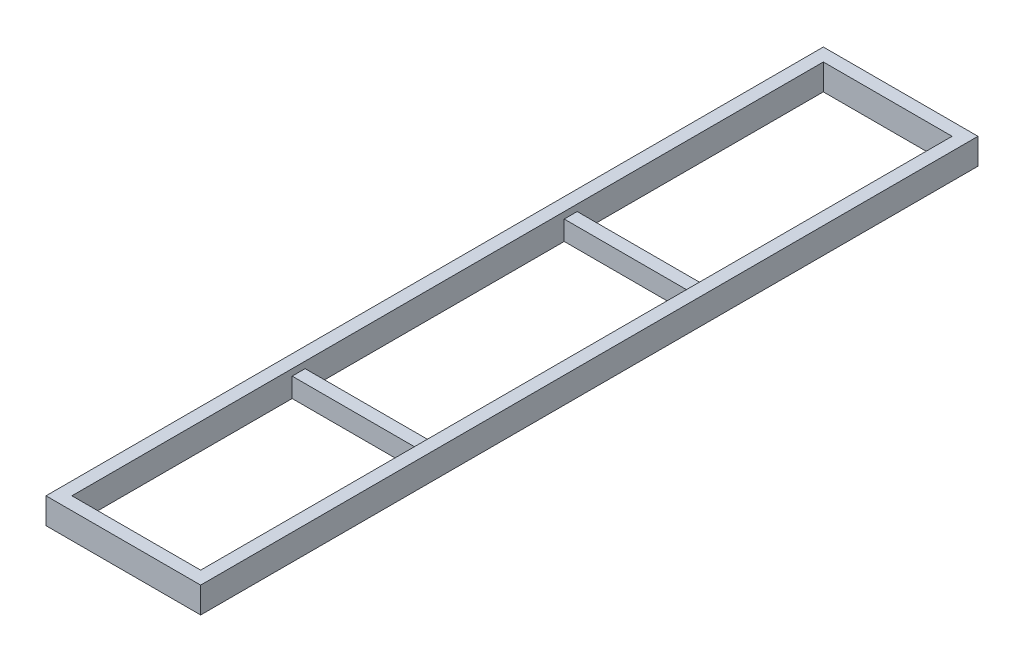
ISO-10303-21;
HEADER;
FILE_DESCRIPTION(('STEP AP214'),'2;1');
FILE_NAME('part.step','',(''),(''),'','','');
FILE_SCHEMA(('AUTOMOTIVE_DESIGN { 1 0 10303 214 1 1 1 1 }'));
ENDSEC;
DATA;
#1=APPLICATION_CONTEXT('core data for automotive mechanical design processes');
#2=APPLICATION_PROTOCOL_DEFINITION('international standard','automotive_design',2000,#1);
#3=PRODUCT_CONTEXT('',#1,'mechanical');
#4=PRODUCT('Part','Part','',(#3));
#5=PRODUCT_RELATED_PRODUCT_CATEGORY('part','',(#4));
#6=PRODUCT_DEFINITION_FORMATION('','',#4);
#7=PRODUCT_DEFINITION_CONTEXT('part definition',#1,'design');
#8=PRODUCT_DEFINITION('design','',#6,#7);
#9=PRODUCT_DEFINITION_SHAPE('','',#8);
#10=(LENGTH_UNIT() NAMED_UNIT(*) SI_UNIT(.MILLI.,.METRE.));
#11=(NAMED_UNIT(*) PLANE_ANGLE_UNIT() SI_UNIT($,.RADIAN.));
#12=(NAMED_UNIT(*) SI_UNIT($,.STERADIAN.) SOLID_ANGLE_UNIT());
#13=UNCERTAINTY_MEASURE_WITH_UNIT(LENGTH_MEASURE(1.E-05),#10,'distance_accuracy_value','');
#14=(GEOMETRIC_REPRESENTATION_CONTEXT(3) GLOBAL_UNCERTAINTY_ASSIGNED_CONTEXT((#13)) GLOBAL_UNIT_ASSIGNED_CONTEXT((#10,
#11,#12)) REPRESENTATION_CONTEXT('',''));
#15=CARTESIAN_POINT('',(0.,0.,0.));
#16=DIRECTION('',(0.,0.,1.));
#17=DIRECTION('',(1.,0.,0.));
#18=AXIS2_PLACEMENT_3D('',#15,#16,#17);
#19=CARTESIAN_POINT('',(-25.4,-50.8,1524.));
#20=DIRECTION('',(1.,0.,0.));
#21=DIRECTION('',(0.,1.,0.));
#22=AXIS2_PLACEMENT_3D('',#19,#20,#21);
#23=PLANE('',#22);
#24=DIRECTION('',(0.,-1.,0.));
#25=VECTOR('',#24,1.);
#26=CARTESIAN_POINT('',(-25.4,25.4,-457.2));
#27=LINE('',#26,#25);
#28=CARTESIAN_POINT('',(-25.4,25.4,-457.2));
#29=VERTEX_POINT('',#28);
#30=CARTESIAN_POINT('',(-25.4,-50.8,-457.2));
#31=VERTEX_POINT('',#30);
#32=EDGE_CURVE('E429',#29,#31,#27,.T.);
#33=ORIENTED_EDGE('',*,*,#32,.T.);
#34=DIRECTION('',(0.,0.,-1.));
#35=VECTOR('',#34,1.);
#36=CARTESIAN_POINT('',(-25.4,-50.8,1524.));
#37=LINE('',#36,#35);
#38=CARTESIAN_POINT('',(-25.4,-50.8,558.8));
#39=VERTEX_POINT('',#38);
#40=EDGE_CURVE('E781',#39,#31,#37,.T.);
#41=ORIENTED_EDGE('',*,*,#40,.F.);
#42=DIRECTION('',(0.,1.,0.));
#43=VECTOR('',#42,1.);
#44=CARTESIAN_POINT('',(-25.4,25.4,558.8));
#45=LINE('',#44,#43);
#46=CARTESIAN_POINT('',(-25.4,25.4,558.8));
#47=VERTEX_POINT('',#46);
#48=EDGE_CURVE('E489',#39,#47,#45,.T.);
#49=ORIENTED_EDGE('',*,*,#48,.T.);
#50=DIRECTION('',(0.,0.,1.));
#51=VECTOR('',#50,1.);
#52=CARTESIAN_POINT('',(-25.4,25.4,609.6));
#53=LINE('',#52,#51);
#54=CARTESIAN_POINT('',(-25.4,25.4,609.6));
#55=VERTEX_POINT('',#54);
#56=EDGE_CURVE('E493',#47,#55,#53,.T.);
#57=ORIENTED_EDGE('',*,*,#56,.T.);
#58=DIRECTION('',(0.,-1.,0.));
#59=VECTOR('',#58,1.);
#60=CARTESIAN_POINT('',(-25.4,25.4,609.6));
#61=LINE('',#60,#59);
#62=CARTESIAN_POINT('',(-25.4,-50.8,609.6));
#63=VERTEX_POINT('',#62);
#64=EDGE_CURVE('E486',#55,#63,#61,.T.);
#65=ORIENTED_EDGE('',*,*,#64,.T.);
#66=CARTESIAN_POINT('',(-25.4,-50.8,1473.2));
#67=VERTEX_POINT('',#66);
#68=EDGE_CURVE('E777',#67,#63,#37,.T.);
#69=ORIENTED_EDGE('',*,*,#68,.F.);
#70=DIRECTION('',(0.,-1.,0.));
#71=VECTOR('',#70,1.);
#72=CARTESIAN_POINT('',(-25.4,-50.8,1473.2));
#73=LINE('',#72,#71);
#74=CARTESIAN_POINT('',(-25.4,50.8,1473.2));
#75=VERTEX_POINT('',#74);
#76=EDGE_CURVE('E729',#75,#67,#73,.T.);
#77=ORIENTED_EDGE('',*,*,#76,.F.);
#78=DIRECTION('',(0.,0.,-1.));
#79=VECTOR('',#78,1.);
#80=CARTESIAN_POINT('',(-25.4,50.8,1524.));
#81=LINE('',#80,#79);
#82=CARTESIAN_POINT('',(-25.4,50.8,-1473.2));
#83=VERTEX_POINT('',#82);
#84=EDGE_CURVE('E780',#75,#83,#81,.T.);
#85=ORIENTED_EDGE('',*,*,#84,.T.);
#86=DIRECTION('',(0.,1.,0.));
#87=VECTOR('',#86,1.);
#88=CARTESIAN_POINT('',(-25.4,-50.8,-1473.2));
#89=LINE('',#88,#87);
#90=CARTESIAN_POINT('',(-25.4,-50.8,-1473.2));
#91=VERTEX_POINT('',#90);
#92=EDGE_CURVE('E597',#91,#83,#89,.T.);
#93=ORIENTED_EDGE('',*,*,#92,.F.);
#94=CARTESIAN_POINT('',(-25.4,-50.8,-508.));
#95=VERTEX_POINT('',#94);
#96=EDGE_CURVE('E776',#95,#91,#37,.T.);
#97=ORIENTED_EDGE('',*,*,#96,.F.);
#98=DIRECTION('',(0.,1.,0.));
#99=VECTOR('',#98,1.);
#100=CARTESIAN_POINT('',(-25.4,25.4,-508.));
#101=LINE('',#100,#99);
#102=CARTESIAN_POINT('',(-25.4,25.4,-508.));
#103=VERTEX_POINT('',#102);
#104=EDGE_CURVE('E432',#95,#103,#101,.T.);
#105=ORIENTED_EDGE('',*,*,#104,.T.);
#106=DIRECTION('',(0.,0.,1.));
#107=VECTOR('',#106,1.);
#108=CARTESIAN_POINT('',(-25.4,25.4,-457.2));
#109=LINE('',#108,#107);
#110=EDGE_CURVE('E436',#103,#29,#109,.T.);
#111=ORIENTED_EDGE('',*,*,#110,.T.);
#112=EDGE_LOOP('',(#33,#41,#49,#57,#65,#69,#77,#85,#93,#97,#105,#111));
#113=FACE_BOUND('',#112,.T.);
#114=ADVANCED_FACE('F36',(#113),#23,.F.);
#115=CARTESIAN_POINT('',(-530.225,-50.8,1524.));
#116=DIRECTION('',(-1.,0.,0.));
#117=DIRECTION('',(0.,1.,0.));
#118=AXIS2_PLACEMENT_3D('',#115,#116,#117);
#119=PLANE('',#118);
#120=DIRECTION('',(0.,-1.,0.));
#121=VECTOR('',#120,1.);
#122=CARTESIAN_POINT('',(-530.225,25.4,-457.2));
#123=LINE('',#122,#121);
#124=CARTESIAN_POINT('',(-530.225,25.4,-457.2));
#125=VERTEX_POINT('',#124);
#126=CARTESIAN_POINT('',(-530.225,-50.8,-457.2));
#127=VERTEX_POINT('',#126);
#128=EDGE_CURVE('E60',#125,#127,#123,.T.);
#129=ORIENTED_EDGE('',*,*,#128,.F.);
#130=DIRECTION('',(0.,0.,1.));
#131=VECTOR('',#130,1.);
#132=CARTESIAN_POINT('',(-530.225,25.4,-457.2));
#133=LINE('',#132,#131);
#134=CARTESIAN_POINT('',(-530.225,25.4,-508.));
#135=VERTEX_POINT('',#134);
#136=EDGE_CURVE('E433',#135,#125,#133,.T.);
#137=ORIENTED_EDGE('',*,*,#136,.F.);
#138=DIRECTION('',(0.,1.,0.));
#139=VECTOR('',#138,1.);
#140=CARTESIAN_POINT('',(-530.225,25.4,-508.));
#141=LINE('',#140,#139);
#142=CARTESIAN_POINT('',(-530.225,-50.8,-508.));
#143=VERTEX_POINT('',#142);
#144=EDGE_CURVE('E441',#143,#135,#141,.T.);
#145=ORIENTED_EDGE('',*,*,#144,.F.);
#146=DIRECTION('',(0.,0.,-1.));
#147=VECTOR('',#146,1.);
#148=CARTESIAN_POINT('',(-530.225,-50.8,1524.));
#149=LINE('',#148,#147);
#150=CARTESIAN_POINT('',(-530.225,-50.8,-1473.2));
#151=VERTEX_POINT('',#150);
#152=EDGE_CURVE('E634',#143,#151,#149,.T.);
#153=ORIENTED_EDGE('',*,*,#152,.T.);
#154=DIRECTION('',(0.,-1.,0.));
#155=VECTOR('',#154,1.);
#156=CARTESIAN_POINT('',(-530.225,-50.8,-1473.2));
#157=LINE('',#156,#155);
#158=CARTESIAN_POINT('',(-530.225,50.8,-1473.2));
#159=VERTEX_POINT('',#158);
#160=EDGE_CURVE('E582',#159,#151,#157,.T.);
#161=ORIENTED_EDGE('',*,*,#160,.F.);
#162=DIRECTION('',(0.,0.,-1.));
#163=VECTOR('',#162,1.);
#164=CARTESIAN_POINT('',(-530.225,50.8,1524.));
#165=LINE('',#164,#163);
#166=CARTESIAN_POINT('',(-530.225,50.8,1473.2));
#167=VERTEX_POINT('',#166);
#168=EDGE_CURVE('E637',#167,#159,#165,.T.);
#169=ORIENTED_EDGE('',*,*,#168,.F.);
#170=DIRECTION('',(0.,-1.,0.));
#171=VECTOR('',#170,1.);
#172=CARTESIAN_POINT('',(-530.225,50.8,1473.2));
#173=LINE('',#172,#171);
#174=CARTESIAN_POINT('',(-530.225,-50.8,1473.2));
#175=VERTEX_POINT('',#174);
#176=EDGE_CURVE('E668',#167,#175,#173,.T.);
#177=ORIENTED_EDGE('',*,*,#176,.T.);
#178=CARTESIAN_POINT('',(-530.225,-50.8,609.6));
#179=VERTEX_POINT('',#178);
#180=EDGE_CURVE('E635',#175,#179,#149,.T.);
#181=ORIENTED_EDGE('',*,*,#180,.T.);
#182=DIRECTION('',(0.,-1.,0.));
#183=VECTOR('',#182,1.);
#184=CARTESIAN_POINT('',(-530.225,25.4,609.6));
#185=LINE('',#184,#183);
#186=CARTESIAN_POINT('',(-530.225,25.4,609.6));
#187=VERTEX_POINT('',#186);
#188=EDGE_CURVE('E485',#187,#179,#185,.T.);
#189=ORIENTED_EDGE('',*,*,#188,.F.);
#190=DIRECTION('',(0.,0.,1.));
#191=VECTOR('',#190,1.);
#192=CARTESIAN_POINT('',(-530.225,25.4,609.6));
#193=LINE('',#192,#191);
#194=CARTESIAN_POINT('',(-530.225,25.4,558.8));
#195=VERTEX_POINT('',#194);
#196=EDGE_CURVE('E490',#195,#187,#193,.T.);
#197=ORIENTED_EDGE('',*,*,#196,.F.);
#198=DIRECTION('',(0.,1.,0.));
#199=VECTOR('',#198,1.);
#200=CARTESIAN_POINT('',(-530.225,25.4,558.8));
#201=LINE('',#200,#199);
#202=CARTESIAN_POINT('',(-530.225,-50.8,558.8));
#203=VERTEX_POINT('',#202);
#204=EDGE_CURVE('E499',#203,#195,#201,.T.);
#205=ORIENTED_EDGE('',*,*,#204,.F.);
#206=EDGE_CURVE('E638',#203,#127,#149,.T.);
#207=ORIENTED_EDGE('',*,*,#206,.T.);
#208=EDGE_LOOP('',(#129,#137,#145,#153,#161,#169,#177,#181,#189,#197,#205,#207));
#209=FACE_BOUND('',#208,.T.);
#210=ADVANCED_FACE('F987',(#209),#119,.F.);
#211=CARTESIAN_POINT('',(25.4,50.8,1473.2));
#212=DIRECTION('',(0.,0.,1.));
#213=DIRECTION('',(1.,0.,0.));
#214=AXIS2_PLACEMENT_3D('',#211,#212,#213);
#215=PLANE('',#214);
#216=ORIENTED_EDGE('',*,*,#176,.F.);
#217=DIRECTION('',(-1.,0.,0.));
#218=VECTOR('',#217,1.);
#219=CARTESIAN_POINT('',(25.4,50.8,1473.2));
#220=LINE('',#219,#218);
#221=EDGE_CURVE('E697',#75,#167,#220,.T.);
#222=ORIENTED_EDGE('',*,*,#221,.F.);
#223=ORIENTED_EDGE('',*,*,#76,.T.);
#224=DIRECTION('',(-1.,0.,0.));
#225=VECTOR('',#224,1.);
#226=CARTESIAN_POINT('',(25.4,-50.8,1473.2));
#227=LINE('',#226,#225);
#228=EDGE_CURVE('E700',#67,#175,#227,.T.);
#229=ORIENTED_EDGE('',*,*,#228,.T.);
#230=EDGE_LOOP('',(#216,#222,#223,#229));
#231=FACE_BOUND('',#230,.T.);
#232=ADVANCED_FACE('F1011',(#231),#215,.F.);
#233=CARTESIAN_POINT('',(0.,0.,1524.));
#234=DIRECTION('',(0.,0.,1.));
#235=DIRECTION('',(1.,0.,0.));
#236=AXIS2_PLACEMENT_3D('',#233,#234,#235);
#237=PLANE('',#236);
#238=DIRECTION('',(1.,0.,0.));
#239=VECTOR('',#238,1.);
#240=CARTESIAN_POINT('',(25.4,-50.8,1524.));
#241=LINE('',#240,#239);
#242=CARTESIAN_POINT('',(-581.025,-50.8,1524.));
#243=VERTEX_POINT('',#242);
#244=CARTESIAN_POINT('',(25.4,-50.8,1524.));
#245=VERTEX_POINT('',#244);
#246=EDGE_CURVE('E765',#243,#245,#241,.T.);
#247=ORIENTED_EDGE('',*,*,#246,.T.);
#248=DIRECTION('',(0.,1.,0.));
#249=VECTOR('',#248,1.);
#250=CARTESIAN_POINT('',(25.4,-50.8,1524.));
#251=LINE('',#250,#249);
#252=CARTESIAN_POINT('',(25.4,50.8,1524.));
#253=VERTEX_POINT('',#252);
#254=EDGE_CURVE('E758',#245,#253,#251,.T.);
#255=ORIENTED_EDGE('',*,*,#254,.T.);
#256=DIRECTION('',(-1.,0.,0.));
#257=VECTOR('',#256,1.);
#258=CARTESIAN_POINT('',(25.4,50.8,1524.));
#259=LINE('',#258,#257);
#260=CARTESIAN_POINT('',(-581.025,50.8,1524.));
#261=VERTEX_POINT('',#260);
#262=EDGE_CURVE('E761',#253,#261,#259,.T.);
#263=ORIENTED_EDGE('',*,*,#262,.T.);
#264=DIRECTION('',(0.,-1.,0.));
#265=VECTOR('',#264,1.);
#266=CARTESIAN_POINT('',(-581.025,50.8,1524.));
#267=LINE('',#266,#265);
#268=EDGE_CURVE('E689',#261,#243,#267,.T.);
#269=ORIENTED_EDGE('',*,*,#268,.T.);
#270=EDGE_LOOP('',(#247,#255,#263,#269));
#271=FACE_BOUND('',#270,.T.);
#272=ADVANCED_FACE('F1016',(#271),#237,.T.);
#273=CARTESIAN_POINT('',(0.,0.,-1524.));
#274=DIRECTION('',(0.,0.,1.));
#275=DIRECTION('',(1.,0.,0.));
#276=AXIS2_PLACEMENT_3D('',#273,#274,#275);
#277=PLANE('',#276);
#278=DIRECTION('',(0.,1.,0.));
#279=VECTOR('',#278,1.);
#280=CARTESIAN_POINT('',(25.4,-50.8,-1524.));
#281=LINE('',#280,#279);
#282=CARTESIAN_POINT('',(25.4,-50.8,-1524.));
#283=VERTEX_POINT('',#282);
#284=CARTESIAN_POINT('',(25.4,50.8,-1524.));
#285=VERTEX_POINT('',#284);
#286=EDGE_CURVE('E768',#283,#285,#281,.T.);
#287=ORIENTED_EDGE('',*,*,#286,.F.);
#288=DIRECTION('',(1.,0.,0.));
#289=VECTOR('',#288,1.);
#290=CARTESIAN_POINT('',(25.4,-50.8,-1524.));
#291=LINE('',#290,#289);
#292=CARTESIAN_POINT('',(-581.025,-50.8,-1524.));
#293=VERTEX_POINT('',#292);
#294=EDGE_CURVE('E762',#293,#283,#291,.T.);
#295=ORIENTED_EDGE('',*,*,#294,.F.);
#296=DIRECTION('',(0.,1.,0.));
#297=VECTOR('',#296,1.);
#298=CARTESIAN_POINT('',(-581.025,-50.8,-1524.));
#299=LINE('',#298,#297);
#300=CARTESIAN_POINT('',(-581.025,50.8,-1524.));
#301=VERTEX_POINT('',#300);
#302=EDGE_CURVE('E631',#293,#301,#299,.T.);
#303=ORIENTED_EDGE('',*,*,#302,.T.);
#304=DIRECTION('',(-1.,0.,0.));
#305=VECTOR('',#304,1.);
#306=CARTESIAN_POINT('',(25.4,50.8,-1524.));
#307=LINE('',#306,#305);
#308=EDGE_CURVE('E771',#285,#301,#307,.T.);
#309=ORIENTED_EDGE('',*,*,#308,.F.);
#310=EDGE_LOOP('',(#287,#295,#303,#309));
#311=FACE_BOUND('',#310,.T.);
#312=ADVANCED_FACE('F1134',(#311),#277,.F.);
#313=CARTESIAN_POINT('',(25.4,-50.8,1524.));
#314=DIRECTION('',(-1.,0.,0.));
#315=DIRECTION('',(0.,0.,1.));
#316=AXIS2_PLACEMENT_3D('',#313,#314,#315);
#317=PLANE('',#316);
#318=ORIENTED_EDGE('',*,*,#286,.T.);
#319=DIRECTION('',(0.,0.,-1.));
#320=VECTOR('',#319,1.);
#321=CARTESIAN_POINT('',(25.4,50.8,1524.));
#322=LINE('',#321,#320);
#323=EDGE_CURVE('E784',#253,#285,#322,.T.);
#324=ORIENTED_EDGE('',*,*,#323,.F.);
#325=ORIENTED_EDGE('',*,*,#254,.F.);
#326=DIRECTION('',(0.,0.,-1.));
#327=VECTOR('',#326,1.);
#328=CARTESIAN_POINT('',(25.4,-50.8,1524.));
#329=LINE('',#328,#327);
#330=EDGE_CURVE('E767',#245,#283,#329,.T.);
#331=ORIENTED_EDGE('',*,*,#330,.T.);
#332=EDGE_LOOP('',(#318,#324,#325,#331));
#333=FACE_BOUND('',#332,.T.);
#334=ADVANCED_FACE('F38',(#333),#317,.F.);
#335=CARTESIAN_POINT('',(25.4,50.8,1524.));
#336=DIRECTION('',(0.,-1.,0.));
#337=DIRECTION('',(1.,0.,0.));
#338=AXIS2_PLACEMENT_3D('',#335,#336,#337);
#339=PLANE('',#338);
#340=ORIENTED_EDGE('',*,*,#308,.T.);
#341=DIRECTION('',(0.,0.,1.));
#342=VECTOR('',#341,1.);
#343=CARTESIAN_POINT('',(-581.025,50.8,1524.));
#344=LINE('',#343,#342);
#345=EDGE_CURVE('E695',#301,#261,#344,.T.);
#346=ORIENTED_EDGE('',*,*,#345,.T.);
#347=ORIENTED_EDGE('',*,*,#262,.F.);
#348=ORIENTED_EDGE('',*,*,#323,.T.);
#349=EDGE_LOOP('',(#340,#346,#347,#348));
#350=FACE_BOUND('',#349,.T.);
#351=DIRECTION('',(-1.,0.,0.));
#352=VECTOR('',#351,1.);
#353=CARTESIAN_POINT('',(25.4,50.8,-1473.2));
#354=LINE('',#353,#352);
#355=EDGE_CURVE('E534',#83,#159,#354,.T.);
#356=ORIENTED_EDGE('',*,*,#355,.F.);
#357=ORIENTED_EDGE('',*,*,#84,.F.);
#358=ORIENTED_EDGE('',*,*,#221,.T.);
#359=ORIENTED_EDGE('',*,*,#168,.T.);
#360=EDGE_LOOP('',(#356,#357,#358,#359));
#361=FACE_BOUND('',#360,.T.);
#362=ADVANCED_FACE('F1118',(#350,#361),#339,.F.);
#363=CARTESIAN_POINT('',(25.4,-50.8,1524.));
#364=DIRECTION('',(0.,1.,0.));
#365=DIRECTION('',(0.,0.,1.));
#366=AXIS2_PLACEMENT_3D('',#363,#364,#365);
#367=PLANE('',#366);
#368=DIRECTION('',(-1.,0.,0.));
#369=VECTOR('',#368,1.);
#370=CARTESIAN_POINT('',(-25.4,-50.8,-508.));
#371=LINE('',#370,#369);
#372=EDGE_CURVE('E450',#95,#143,#371,.T.);
#373=ORIENTED_EDGE('',*,*,#372,.F.);
#374=ORIENTED_EDGE('',*,*,#96,.T.);
#375=DIRECTION('',(-1.,0.,0.));
#376=VECTOR('',#375,1.);
#377=CARTESIAN_POINT('',(25.4,-50.8,-1473.2));
#378=LINE('',#377,#376);
#379=EDGE_CURVE('E531',#91,#151,#378,.T.);
#380=ORIENTED_EDGE('',*,*,#379,.T.);
#381=ORIENTED_EDGE('',*,*,#152,.F.);
#382=EDGE_LOOP('',(#373,#374,#380,#381));
#383=FACE_BOUND('',#382,.T.);
#384=DIRECTION('',(-1.,0.,0.));
#385=VECTOR('',#384,1.);
#386=CARTESIAN_POINT('',(-25.4,-50.8,558.8));
#387=LINE('',#386,#385);
#388=EDGE_CURVE('E509',#39,#203,#387,.T.);
#389=ORIENTED_EDGE('',*,*,#388,.F.);
#390=ORIENTED_EDGE('',*,*,#40,.T.);
#391=DIRECTION('',(-1.,0.,0.));
#392=VECTOR('',#391,1.);
#393=CARTESIAN_POINT('',(-25.4,-50.8,-457.2));
#394=LINE('',#393,#392);
#395=EDGE_CURVE('E453',#31,#127,#394,.T.);
#396=ORIENTED_EDGE('',*,*,#395,.T.);
#397=ORIENTED_EDGE('',*,*,#206,.F.);
#398=EDGE_LOOP('',(#389,#390,#396,#397));
#399=FACE_BOUND('',#398,.T.);
#400=ORIENTED_EDGE('',*,*,#68,.T.);
#401=DIRECTION('',(-1.,0.,0.));
#402=VECTOR('',#401,1.);
#403=CARTESIAN_POINT('',(-25.4,-50.8,609.6));
#404=LINE('',#403,#402);
#405=EDGE_CURVE('E512',#63,#179,#404,.T.);
#406=ORIENTED_EDGE('',*,*,#405,.T.);
#407=ORIENTED_EDGE('',*,*,#180,.F.);
#408=ORIENTED_EDGE('',*,*,#228,.F.);
#409=EDGE_LOOP('',(#400,#406,#407,#408));
#410=FACE_BOUND('',#409,.T.);
#411=DIRECTION('',(0.,0.,-1.));
#412=VECTOR('',#411,1.);
#413=CARTESIAN_POINT('',(-581.025,-50.8,1524.));
#414=LINE('',#413,#412);
#415=EDGE_CURVE('E692',#243,#293,#414,.T.);
#416=ORIENTED_EDGE('',*,*,#415,.T.);
#417=ORIENTED_EDGE('',*,*,#294,.T.);
#418=ORIENTED_EDGE('',*,*,#330,.F.);
#419=ORIENTED_EDGE('',*,*,#246,.F.);
#420=EDGE_LOOP('',(#416,#417,#418,#419));
#421=FACE_BOUND('',#420,.T.);
#422=ADVANCED_FACE('F1100',(#383,#399,#410,#421),#367,.F.);
#423=CARTESIAN_POINT('',(-581.025,0.,0.));
#424=DIRECTION('',(1.,0.,0.));
#425=DIRECTION('',(0.,0.,-1.));
#426=AXIS2_PLACEMENT_3D('',#423,#424,#425);
#427=PLANE('',#426);
#428=ORIENTED_EDGE('',*,*,#302,.F.);
#429=ORIENTED_EDGE('',*,*,#415,.F.);
#430=ORIENTED_EDGE('',*,*,#268,.F.);
#431=ORIENTED_EDGE('',*,*,#345,.F.);
#432=EDGE_LOOP('',(#428,#429,#430,#431));
#433=FACE_BOUND('',#432,.T.);
#434=ADVANCED_FACE('F1124',(#433),#427,.F.);
#435=CARTESIAN_POINT('',(25.4,50.8,-1473.2));
#436=DIRECTION('',(0.,0.,-1.));
#437=DIRECTION('',(-1.,0.,0.));
#438=AXIS2_PLACEMENT_3D('',#435,#436,#437);
#439=PLANE('',#438);
#440=ORIENTED_EDGE('',*,*,#379,.F.);
#441=ORIENTED_EDGE('',*,*,#92,.T.);
#442=ORIENTED_EDGE('',*,*,#355,.T.);
#443=ORIENTED_EDGE('',*,*,#160,.T.);
#444=EDGE_LOOP('',(#440,#441,#442,#443));
#445=FACE_BOUND('',#444,.T.);
#446=ADVANCED_FACE('F1078',(#445),#439,.F.);
#447=CARTESIAN_POINT('',(-25.4,25.4,609.6));
#448=DIRECTION('',(0.,-1.,0.));
#449=DIRECTION('',(0.,0.,-1.));
#450=AXIS2_PLACEMENT_3D('',#447,#448,#449);
#451=PLANE('',#450);
#452=ORIENTED_EDGE('',*,*,#196,.T.);
#453=DIRECTION('',(-1.,0.,0.));
#454=VECTOR('',#453,1.);
#455=CARTESIAN_POINT('',(-25.4,25.4,609.6));
#456=LINE('',#455,#454);
#457=EDGE_CURVE('E496',#55,#187,#456,.T.);
#458=ORIENTED_EDGE('',*,*,#457,.F.);
#459=ORIENTED_EDGE('',*,*,#56,.F.);
#460=DIRECTION('',(-1.,0.,0.));
#461=VECTOR('',#460,1.);
#462=CARTESIAN_POINT('',(-25.4,25.4,558.8));
#463=LINE('',#462,#461);
#464=EDGE_CURVE('E506',#47,#195,#463,.T.);
#465=ORIENTED_EDGE('',*,*,#464,.T.);
#466=EDGE_LOOP('',(#452,#458,#459,#465));
#467=FACE_BOUND('',#466,.T.);
#468=ADVANCED_FACE('F1074',(#467),#451,.F.);
#469=CARTESIAN_POINT('',(-25.4,25.4,558.8));
#470=DIRECTION('',(0.,0.,1.));
#471=DIRECTION('',(1.,0.,0.));
#472=AXIS2_PLACEMENT_3D('',#469,#470,#471);
#473=PLANE('',#472);
#474=ORIENTED_EDGE('',*,*,#204,.T.);
#475=ORIENTED_EDGE('',*,*,#464,.F.);
#476=ORIENTED_EDGE('',*,*,#48,.F.);
#477=ORIENTED_EDGE('',*,*,#388,.T.);
#478=EDGE_LOOP('',(#474,#475,#476,#477));
#479=FACE_BOUND('',#478,.T.);
#480=ADVANCED_FACE('F1077',(#479),#473,.F.);
#481=CARTESIAN_POINT('',(-25.4,25.4,609.6));
#482=DIRECTION('',(0.,0.,-1.));
#483=DIRECTION('',(-1.,0.,0.));
#484=AXIS2_PLACEMENT_3D('',#481,#482,#483);
#485=PLANE('',#484);
#486=ORIENTED_EDGE('',*,*,#188,.T.);
#487=ORIENTED_EDGE('',*,*,#405,.F.);
#488=ORIENTED_EDGE('',*,*,#64,.F.);
#489=ORIENTED_EDGE('',*,*,#457,.T.);
#490=EDGE_LOOP('',(#486,#487,#488,#489));
#491=FACE_BOUND('',#490,.T.);
#492=ADVANCED_FACE('F1082',(#491),#485,.F.);
#493=CARTESIAN_POINT('',(-25.4,25.4,-457.2));
#494=DIRECTION('',(0.,-1.,0.));
#495=DIRECTION('',(0.,0.,-1.));
#496=AXIS2_PLACEMENT_3D('',#493,#494,#495);
#497=PLANE('',#496);
#498=ORIENTED_EDGE('',*,*,#136,.T.);
#499=DIRECTION('',(-1.,0.,0.));
#500=VECTOR('',#499,1.);
#501=CARTESIAN_POINT('',(-25.4,25.4,-457.2));
#502=LINE('',#501,#500);
#503=EDGE_CURVE('E439',#29,#125,#502,.T.);
#504=ORIENTED_EDGE('',*,*,#503,.F.);
#505=ORIENTED_EDGE('',*,*,#110,.F.);
#506=DIRECTION('',(-1.,0.,0.));
#507=VECTOR('',#506,1.);
#508=CARTESIAN_POINT('',(-25.4,25.4,-508.));
#509=LINE('',#508,#507);
#510=EDGE_CURVE('E447',#103,#135,#509,.T.);
#511=ORIENTED_EDGE('',*,*,#510,.T.);
#512=EDGE_LOOP('',(#498,#504,#505,#511));
#513=FACE_BOUND('',#512,.T.);
#514=ADVANCED_FACE('F1085',(#513),#497,.F.);
#515=CARTESIAN_POINT('',(-25.4,25.4,-508.));
#516=DIRECTION('',(0.,0.,1.));
#517=DIRECTION('',(1.,0.,0.));
#518=AXIS2_PLACEMENT_3D('',#515,#516,#517);
#519=PLANE('',#518);
#520=ORIENTED_EDGE('',*,*,#144,.T.);
#521=ORIENTED_EDGE('',*,*,#510,.F.);
#522=ORIENTED_EDGE('',*,*,#104,.F.);
#523=ORIENTED_EDGE('',*,*,#372,.T.);
#524=EDGE_LOOP('',(#520,#521,#522,#523));
#525=FACE_BOUND('',#524,.T.);
#526=ADVANCED_FACE('F1090',(#525),#519,.F.);
#527=CARTESIAN_POINT('',(-25.4,25.4,-457.2));
#528=DIRECTION('',(0.,0.,-1.));
#529=DIRECTION('',(-1.,0.,0.));
#530=AXIS2_PLACEMENT_3D('',#527,#528,#529);
#531=PLANE('',#530);
#532=ORIENTED_EDGE('',*,*,#128,.T.);
#533=ORIENTED_EDGE('',*,*,#395,.F.);
#534=ORIENTED_EDGE('',*,*,#32,.F.);
#535=ORIENTED_EDGE('',*,*,#503,.T.);
#536=EDGE_LOOP('',(#532,#533,#534,#535));
#537=FACE_BOUND('',#536,.T.);
#538=ADVANCED_FACE('F1105',(#537),#531,.F.);
#539=CLOSED_SHELL('',(#114,#210,#232,#272,#312,#334,#362,#422,#434,#446,#468,#480,#492,#514,
#526,#538));
#540=DIRECTION('',(0.,0.,1.));
#541=VECTOR('',#540,1.);
#542=CARTESIAN_POINT('',(-530.225,22.225,-460.375));
#543=LINE('',#542,#541);
#544=CARTESIAN_POINT('',(-530.225,22.225,-504.825));
#545=VERTEX_POINT('',#544);
#546=CARTESIAN_POINT('',(-530.225,22.225,-460.375));
#547=VERTEX_POINT('',#546);
#548=EDGE_CURVE('E403',#545,#547,#543,.T.);
#549=ORIENTED_EDGE('',*,*,#548,.T.);
#550=DIRECTION('',(0.,-1.,0.));
#551=VECTOR('',#550,1.);
#552=CARTESIAN_POINT('',(-530.225,22.225,-460.375));
#553=LINE('',#552,#551);
#554=CARTESIAN_POINT('',(-530.225,-47.625,-460.375));
#555=VERTEX_POINT('',#554);
#556=EDGE_CURVE('E417',#547,#555,#553,.T.);
#557=ORIENTED_EDGE('',*,*,#556,.T.);
#558=DIRECTION('',(0.,0.,-1.));
#559=VECTOR('',#558,1.);
#560=CARTESIAN_POINT('',(-530.225,-47.625,-460.375));
#561=LINE('',#560,#559);
#562=CARTESIAN_POINT('',(-530.225,-47.625,-504.825));
#563=VERTEX_POINT('',#562);
#564=EDGE_CURVE('E408',#555,#563,#561,.T.);
#565=ORIENTED_EDGE('',*,*,#564,.T.);
#566=DIRECTION('',(0.,1.,0.));
#567=VECTOR('',#566,1.);
#568=CARTESIAN_POINT('',(-530.225,22.225,-504.825));
#569=LINE('',#568,#567);
#570=EDGE_CURVE('E420',#563,#545,#569,.T.);
#571=ORIENTED_EDGE('',*,*,#570,.T.);
#572=EDGE_LOOP('',(#549,#557,#565,#571));
#573=FACE_BOUND('',#572,.T.);
#574=ADVANCED_FACE('F992',(#573),#119,.F.);
#575=CARTESIAN_POINT('',(-25.4,22.225,-460.375));
#576=DIRECTION('',(0.,0.,-1.));
#577=DIRECTION('',(-1.,0.,0.));
#578=AXIS2_PLACEMENT_3D('',#575,#576,#577);
#579=PLANE('',#578);
#580=ORIENTED_EDGE('',*,*,#556,.F.);
#581=DIRECTION('',(-1.,0.,0.));
#582=VECTOR('',#581,1.);
#583=CARTESIAN_POINT('',(-25.4,22.225,-460.375));
#584=LINE('',#583,#582);
#585=CARTESIAN_POINT('',(-25.4,22.225,-460.375));
#586=VERTEX_POINT('',#585);
#587=EDGE_CURVE('E398',#586,#547,#584,.T.);
#588=ORIENTED_EDGE('',*,*,#587,.F.);
#589=DIRECTION('',(0.,-1.,0.));
#590=VECTOR('',#589,1.);
#591=CARTESIAN_POINT('',(-25.4,22.225,-460.375));
#592=LINE('',#591,#590);
#593=CARTESIAN_POINT('',(-25.4,-47.625,-460.375));
#594=VERTEX_POINT('',#593);
#595=EDGE_CURVE('E392',#586,#594,#592,.T.);
#596=ORIENTED_EDGE('',*,*,#595,.T.);
#597=DIRECTION('',(-1.,0.,0.));
#598=VECTOR('',#597,1.);
#599=CARTESIAN_POINT('',(-25.4,-47.625,-460.375));
#600=LINE('',#599,#598);
#601=EDGE_CURVE('E396',#594,#555,#600,.T.);
#602=ORIENTED_EDGE('',*,*,#601,.T.);
#603=EDGE_LOOP('',(#580,#588,#596,#602));
#604=FACE_BOUND('',#603,.T.);
#605=ADVANCED_FACE('F395',(#604),#579,.T.);
#606=CARTESIAN_POINT('',(-25.4,-47.625,-460.375));
#607=DIRECTION('',(0.,1.,0.));
#608=DIRECTION('',(0.,0.,1.));
#609=AXIS2_PLACEMENT_3D('',#606,#607,#608);
#610=PLANE('',#609);
#611=ORIENTED_EDGE('',*,*,#564,.F.);
#612=ORIENTED_EDGE('',*,*,#601,.F.);
#613=DIRECTION('',(0.,0.,-1.));
#614=VECTOR('',#613,1.);
#615=CARTESIAN_POINT('',(-25.4,-47.625,-460.375));
#616=LINE('',#615,#614);
#617=CARTESIAN_POINT('',(-25.4,-47.625,-504.825));
#618=VERTEX_POINT('',#617);
#619=EDGE_CURVE('E402',#594,#618,#616,.T.);
#620=ORIENTED_EDGE('',*,*,#619,.T.);
#621=DIRECTION('',(-1.,0.,0.));
#622=VECTOR('',#621,1.);
#623=CARTESIAN_POINT('',(-25.4,-47.625,-504.825));
#624=LINE('',#623,#622);
#625=EDGE_CURVE('E409',#618,#563,#624,.T.);
#626=ORIENTED_EDGE('',*,*,#625,.T.);
#627=EDGE_LOOP('',(#611,#612,#620,#626));
#628=FACE_BOUND('',#627,.T.);
#629=ADVANCED_FACE('F406',(#628),#610,.T.);
#630=CARTESIAN_POINT('',(-25.4,22.225,-504.825));
#631=DIRECTION('',(0.,0.,1.));
#632=DIRECTION('',(1.,0.,0.));
#633=AXIS2_PLACEMENT_3D('',#630,#631,#632);
#634=PLANE('',#633);
#635=ORIENTED_EDGE('',*,*,#570,.F.);
#636=ORIENTED_EDGE('',*,*,#625,.F.);
#637=DIRECTION('',(0.,1.,0.));
#638=VECTOR('',#637,1.);
#639=CARTESIAN_POINT('',(-25.4,22.225,-504.825));
#640=LINE('',#639,#638);
#641=CARTESIAN_POINT('',(-25.4,22.225,-504.825));
#642=VERTEX_POINT('',#641);
#643=EDGE_CURVE('E52',#618,#642,#640,.T.);
#644=ORIENTED_EDGE('',*,*,#643,.T.);
#645=DIRECTION('',(-1.,0.,0.));
#646=VECTOR('',#645,1.);
#647=CARTESIAN_POINT('',(-25.4,22.225,-504.825));
#648=LINE('',#647,#646);
#649=EDGE_CURVE('E426',#642,#545,#648,.T.);
#650=ORIENTED_EDGE('',*,*,#649,.T.);
#651=EDGE_LOOP('',(#635,#636,#644,#650));
#652=FACE_BOUND('',#651,.T.);
#653=ADVANCED_FACE('F1343',(#652),#634,.T.);
#654=CARTESIAN_POINT('',(-25.4,22.225,-460.375));
#655=DIRECTION('',(0.,-1.,0.));
#656=DIRECTION('',(0.,0.,-1.));
#657=AXIS2_PLACEMENT_3D('',#654,#655,#656);
#658=PLANE('',#657);
#659=ORIENTED_EDGE('',*,*,#548,.F.);
#660=ORIENTED_EDGE('',*,*,#649,.F.);
#661=DIRECTION('',(0.,0.,1.));
#662=VECTOR('',#661,1.);
#663=CARTESIAN_POINT('',(-25.4,22.225,-460.375));
#664=LINE('',#663,#662);
#665=EDGE_CURVE('E413',#642,#586,#664,.T.);
#666=ORIENTED_EDGE('',*,*,#665,.T.);
#667=ORIENTED_EDGE('',*,*,#587,.T.);
#668=EDGE_LOOP('',(#659,#660,#666,#667));
#669=FACE_BOUND('',#668,.T.);
#670=ADVANCED_FACE('F1026',(#669),#658,.T.);
#671=ORIENTED_EDGE('',*,*,#619,.F.);
#672=ORIENTED_EDGE('',*,*,#595,.F.);
#673=ORIENTED_EDGE('',*,*,#665,.F.);
#674=ORIENTED_EDGE('',*,*,#643,.F.);
#675=EDGE_LOOP('',(#671,#672,#673,#674));
#676=FACE_BOUND('',#675,.T.);
#677=ADVANCED_FACE('F411',(#676),#23,.F.);
#678=CLOSED_SHELL('',(#574,#605,#629,#653,#670,#677));
#679=DIRECTION('',(0.,0.,1.));
#680=VECTOR('',#679,1.);
#681=CARTESIAN_POINT('',(-530.225,22.225,606.425));
#682=LINE('',#681,#680);
#683=CARTESIAN_POINT('',(-530.225,22.225,561.975));
#684=VERTEX_POINT('',#683);
#685=CARTESIAN_POINT('',(-530.225,22.225,606.425));
#686=VERTEX_POINT('',#685);
#687=EDGE_CURVE('E460',#684,#686,#682,.T.);
#688=ORIENTED_EDGE('',*,*,#687,.T.);
#689=DIRECTION('',(0.,-1.,0.));
#690=VECTOR('',#689,1.);
#691=CARTESIAN_POINT('',(-530.225,22.225,606.425));
#692=LINE('',#691,#690);
#693=CARTESIAN_POINT('',(-530.225,-47.625,606.425));
#694=VERTEX_POINT('',#693);
#695=EDGE_CURVE('E456',#686,#694,#692,.T.);
#696=ORIENTED_EDGE('',*,*,#695,.T.);
#697=DIRECTION('',(0.,0.,-1.));
#698=VECTOR('',#697,1.);
#699=CARTESIAN_POINT('',(-530.225,-47.625,606.425));
#700=LINE('',#699,#698);
#701=CARTESIAN_POINT('',(-530.225,-47.625,561.975));
#702=VERTEX_POINT('',#701);
#703=EDGE_CURVE('E469',#694,#702,#700,.T.);
#704=ORIENTED_EDGE('',*,*,#703,.T.);
#705=DIRECTION('',(0.,1.,0.));
#706=VECTOR('',#705,1.);
#707=CARTESIAN_POINT('',(-530.225,22.225,561.975));
#708=LINE('',#707,#706);
#709=EDGE_CURVE('E472',#702,#684,#708,.T.);
#710=ORIENTED_EDGE('',*,*,#709,.T.);
#711=EDGE_LOOP('',(#688,#696,#704,#710));
#712=FACE_BOUND('',#711,.T.);
#713=ADVANCED_FACE('F978',(#712),#119,.F.);
#714=CARTESIAN_POINT('',(-25.4,22.225,606.425));
#715=DIRECTION('',(0.,0.,-1.));
#716=DIRECTION('',(-1.,0.,0.));
#717=AXIS2_PLACEMENT_3D('',#714,#715,#716);
#718=PLANE('',#717);
#719=ORIENTED_EDGE('',*,*,#695,.F.);
#720=DIRECTION('',(-1.,0.,0.));
#721=VECTOR('',#720,1.);
#722=CARTESIAN_POINT('',(-25.4,22.225,606.425));
#723=LINE('',#722,#721);
#724=CARTESIAN_POINT('',(-25.4,22.225,606.425));
#725=VERTEX_POINT('',#724);
#726=EDGE_CURVE('E466',#725,#686,#723,.T.);
#727=ORIENTED_EDGE('',*,*,#726,.F.);
#728=DIRECTION('',(0.,-1.,0.));
#729=VECTOR('',#728,1.);
#730=CARTESIAN_POINT('',(-25.4,22.225,606.425));
#731=LINE('',#730,#729);
#732=CARTESIAN_POINT('',(-25.4,-47.625,606.425));
#733=VERTEX_POINT('',#732);
#734=EDGE_CURVE('E457',#725,#733,#731,.T.);
#735=ORIENTED_EDGE('',*,*,#734,.T.);
#736=DIRECTION('',(-1.,0.,0.));
#737=VECTOR('',#736,1.);
#738=CARTESIAN_POINT('',(-25.4,-47.625,606.425));
#739=LINE('',#738,#737);
#740=EDGE_CURVE('E482',#733,#694,#739,.T.);
#741=ORIENTED_EDGE('',*,*,#740,.T.);
#742=EDGE_LOOP('',(#719,#727,#735,#741));
#743=FACE_BOUND('',#742,.T.);
#744=ADVANCED_FACE('F989',(#743),#718,.T.);
#745=CARTESIAN_POINT('',(-25.4,-47.625,606.425));
#746=DIRECTION('',(0.,1.,0.));
#747=DIRECTION('',(0.,0.,1.));
#748=AXIS2_PLACEMENT_3D('',#745,#746,#747);
#749=PLANE('',#748);
#750=ORIENTED_EDGE('',*,*,#703,.F.);
#751=ORIENTED_EDGE('',*,*,#740,.F.);
#752=DIRECTION('',(0.,0.,-1.));
#753=VECTOR('',#752,1.);
#754=CARTESIAN_POINT('',(-25.4,-47.625,606.425));
#755=LINE('',#754,#753);
#756=CARTESIAN_POINT('',(-25.4,-47.625,561.975));
#757=VERTEX_POINT('',#756);
#758=EDGE_CURVE('E459',#733,#757,#755,.T.);
#759=ORIENTED_EDGE('',*,*,#758,.T.);
#760=DIRECTION('',(-1.,0.,0.));
#761=VECTOR('',#760,1.);
#762=CARTESIAN_POINT('',(-25.4,-47.625,561.975));
#763=LINE('',#762,#761);
#764=EDGE_CURVE('E480',#757,#702,#763,.T.);
#765=ORIENTED_EDGE('',*,*,#764,.T.);
#766=EDGE_LOOP('',(#750,#751,#759,#765));
#767=FACE_BOUND('',#766,.T.);
#768=ADVANCED_FACE('F998',(#767),#749,.T.);
#769=CARTESIAN_POINT('',(-25.4,22.225,561.975));
#770=DIRECTION('',(0.,0.,1.));
#771=DIRECTION('',(1.,0.,0.));
#772=AXIS2_PLACEMENT_3D('',#769,#770,#771);
#773=PLANE('',#772);
#774=ORIENTED_EDGE('',*,*,#709,.F.);
#775=ORIENTED_EDGE('',*,*,#764,.F.);
#776=DIRECTION('',(0.,1.,0.));
#777=VECTOR('',#776,1.);
#778=CARTESIAN_POINT('',(-25.4,22.225,561.975));
#779=LINE('',#778,#777);
#780=CARTESIAN_POINT('',(-25.4,22.225,561.975));
#781=VERTEX_POINT('',#780);
#782=EDGE_CURVE('E462',#757,#781,#779,.T.);
#783=ORIENTED_EDGE('',*,*,#782,.T.);
#784=DIRECTION('',(-1.,0.,0.));
#785=VECTOR('',#784,1.);
#786=CARTESIAN_POINT('',(-25.4,22.225,561.975));
#787=LINE('',#786,#785);
#788=EDGE_CURVE('E478',#781,#684,#787,.T.);
#789=ORIENTED_EDGE('',*,*,#788,.T.);
#790=EDGE_LOOP('',(#774,#775,#783,#789));
#791=FACE_BOUND('',#790,.T.);
#792=ADVANCED_FACE('F1050',(#791),#773,.T.);
#793=CARTESIAN_POINT('',(-25.4,22.225,606.425));
#794=DIRECTION('',(0.,-1.,0.));
#795=DIRECTION('',(0.,0.,-1.));
#796=AXIS2_PLACEMENT_3D('',#793,#794,#795);
#797=PLANE('',#796);
#798=ORIENTED_EDGE('',*,*,#687,.F.);
#799=ORIENTED_EDGE('',*,*,#788,.F.);
#800=DIRECTION('',(0.,0.,1.));
#801=VECTOR('',#800,1.);
#802=CARTESIAN_POINT('',(-25.4,22.225,606.425));
#803=LINE('',#802,#801);
#804=EDGE_CURVE('E464',#781,#725,#803,.T.);
#805=ORIENTED_EDGE('',*,*,#804,.T.);
#806=ORIENTED_EDGE('',*,*,#726,.T.);
#807=EDGE_LOOP('',(#798,#799,#805,#806));
#808=FACE_BOUND('',#807,.T.);
#809=ADVANCED_FACE('F1044',(#808),#797,.T.);
#810=ORIENTED_EDGE('',*,*,#758,.F.);
#811=ORIENTED_EDGE('',*,*,#734,.F.);
#812=ORIENTED_EDGE('',*,*,#804,.F.);
#813=ORIENTED_EDGE('',*,*,#782,.F.);
#814=EDGE_LOOP('',(#810,#811,#812,#813));
#815=FACE_BOUND('',#814,.T.);
#816=ADVANCED_FACE('F1027',(#815),#23,.F.);
#817=CLOSED_SHELL('',(#713,#744,#768,#792,#809,#816));
#818=DIRECTION('',(0.,1.,0.));
#819=VECTOR('',#818,1.);
#820=CARTESIAN_POINT('',(22.225,-47.625,1473.2));
#821=LINE('',#820,#819);
#822=CARTESIAN_POINT('',(22.225,-47.625,1473.2));
#823=VERTEX_POINT('',#822);
#824=CARTESIAN_POINT('',(22.225,47.625,1473.2));
#825=VERTEX_POINT('',#824);
#826=EDGE_CURVE('E726',#823,#825,#821,.T.);
#827=ORIENTED_EDGE('',*,*,#826,.F.);
#828=DIRECTION('',(1.,0.,0.));
#829=VECTOR('',#828,1.);
#830=CARTESIAN_POINT('',(22.225,-47.625,1473.2));
#831=LINE('',#830,#829);
#832=CARTESIAN_POINT('',(-22.225,-47.625,1473.2));
#833=VERTEX_POINT('',#832);
#834=EDGE_CURVE('E792',#833,#823,#831,.T.);
#835=ORIENTED_EDGE('',*,*,#834,.F.);
#836=DIRECTION('',(0.,-1.,0.));
#837=VECTOR('',#836,1.);
#838=CARTESIAN_POINT('',(-22.225,-47.625,1473.2));
#839=LINE('',#838,#837);
#840=CARTESIAN_POINT('',(-22.225,47.625,1473.2));
#841=VERTEX_POINT('',#840);
#842=EDGE_CURVE('E720',#841,#833,#839,.T.);
#843=ORIENTED_EDGE('',*,*,#842,.F.);
#844=DIRECTION('',(-1.,0.,0.));
#845=VECTOR('',#844,1.);
#846=CARTESIAN_POINT('',(22.225,47.625,1473.2));
#847=LINE('',#846,#845);
#848=EDGE_CURVE('E723',#825,#841,#847,.T.);
#849=ORIENTED_EDGE('',*,*,#848,.F.);
#850=EDGE_LOOP('',(#827,#835,#843,#849));
#851=FACE_BOUND('',#850,.T.);
#852=ADVANCED_FACE('F1020',(#851),#215,.F.);
#853=CARTESIAN_POINT('',(22.225,-47.625,1524.));
#854=DIRECTION('',(0.,1.,0.));
#855=DIRECTION('',(0.,0.,1.));
#856=AXIS2_PLACEMENT_3D('',#853,#854,#855);
#857=PLANE('',#856);
#858=DIRECTION('',(0.,0.,-1.));
#859=VECTOR('',#858,1.);
#860=CARTESIAN_POINT('',(22.225,-47.625,1524.));
#861=LINE('',#860,#859);
#862=CARTESIAN_POINT('',(22.225,-47.625,-1473.2));
#863=VERTEX_POINT('',#862);
#864=EDGE_CURVE('E739',#823,#863,#861,.T.);
#865=ORIENTED_EDGE('',*,*,#864,.T.);
#866=DIRECTION('',(-1.,0.,0.));
#867=VECTOR('',#866,1.);
#868=CARTESIAN_POINT('',(22.225,-47.625,-1473.2));
#869=LINE('',#868,#867);
#870=CARTESIAN_POINT('',(-22.225,-47.625,-1473.2));
#871=VERTEX_POINT('',#870);
#872=EDGE_CURVE('E585',#863,#871,#869,.T.);
#873=ORIENTED_EDGE('',*,*,#872,.T.);
#874=DIRECTION('',(0.,0.,-1.));
#875=VECTOR('',#874,1.);
#876=CARTESIAN_POINT('',(-22.225,-47.625,1524.));
#877=LINE('',#876,#875);
#878=EDGE_CURVE('E743',#833,#871,#877,.T.);
#879=ORIENTED_EDGE('',*,*,#878,.F.);
#880=ORIENTED_EDGE('',*,*,#834,.T.);
#881=EDGE_LOOP('',(#865,#873,#879,#880));
#882=FACE_BOUND('',#881,.T.);
#883=ADVANCED_FACE('F898',(#882),#857,.T.);
#884=CARTESIAN_POINT('',(-22.225,-47.625,1524.));
#885=DIRECTION('',(1.,0.,0.));
#886=DIRECTION('',(0.,1.,0.));
#887=AXIS2_PLACEMENT_3D('',#884,#885,#886);
#888=PLANE('',#887);
#889=ORIENTED_EDGE('',*,*,#878,.T.);
#890=DIRECTION('',(0.,1.,0.));
#891=VECTOR('',#890,1.);
#892=CARTESIAN_POINT('',(-22.225,-47.625,-1473.2));
#893=LINE('',#892,#891);
#894=CARTESIAN_POINT('',(-22.225,47.625,-1473.2));
#895=VERTEX_POINT('',#894);
#896=EDGE_CURVE('E588',#871,#895,#893,.T.);
#897=ORIENTED_EDGE('',*,*,#896,.T.);
#898=DIRECTION('',(0.,0.,-1.));
#899=VECTOR('',#898,1.);
#900=CARTESIAN_POINT('',(-22.225,47.625,1524.));
#901=LINE('',#900,#899);
#902=EDGE_CURVE('E748',#841,#895,#901,.T.);
#903=ORIENTED_EDGE('',*,*,#902,.F.);
#904=ORIENTED_EDGE('',*,*,#842,.T.);
#905=EDGE_LOOP('',(#889,#897,#903,#904));
#906=FACE_BOUND('',#905,.T.);
#907=ADVANCED_FACE('F1160',(#906),#888,.T.);
#908=CARTESIAN_POINT('',(22.225,47.625,1524.));
#909=DIRECTION('',(0.,-1.,0.));
#910=DIRECTION('',(1.,0.,0.));
#911=AXIS2_PLACEMENT_3D('',#908,#909,#910);
#912=PLANE('',#911);
#913=ORIENTED_EDGE('',*,*,#902,.T.);
#914=DIRECTION('',(1.,0.,0.));
#915=VECTOR('',#914,1.);
#916=CARTESIAN_POINT('',(22.225,47.625,-1473.2));
#917=LINE('',#916,#915);
#918=CARTESIAN_POINT('',(22.225,47.625,-1473.2));
#919=VERTEX_POINT('',#918);
#920=EDGE_CURVE('E591',#895,#919,#917,.T.);
#921=ORIENTED_EDGE('',*,*,#920,.T.);
#922=DIRECTION('',(0.,0.,-1.));
#923=VECTOR('',#922,1.);
#924=CARTESIAN_POINT('',(22.225,47.625,1524.));
#925=LINE('',#924,#923);
#926=EDGE_CURVE('E753',#825,#919,#925,.T.);
#927=ORIENTED_EDGE('',*,*,#926,.F.);
#928=ORIENTED_EDGE('',*,*,#848,.T.);
#929=EDGE_LOOP('',(#913,#921,#927,#928));
#930=FACE_BOUND('',#929,.T.);
#931=ADVANCED_FACE('F1158',(#930),#912,.T.);
#932=CARTESIAN_POINT('',(22.225,-47.625,1524.));
#933=DIRECTION('',(-1.,0.,0.));
#934=DIRECTION('',(0.,0.,1.));
#935=AXIS2_PLACEMENT_3D('',#932,#933,#934);
#936=PLANE('',#935);
#937=ORIENTED_EDGE('',*,*,#926,.T.);
#938=DIRECTION('',(0.,-1.,0.));
#939=VECTOR('',#938,1.);
#940=CARTESIAN_POINT('',(22.225,-47.625,-1473.2));
#941=LINE('',#940,#939);
#942=EDGE_CURVE('E594',#919,#863,#941,.T.);
#943=ORIENTED_EDGE('',*,*,#942,.T.);
#944=ORIENTED_EDGE('',*,*,#864,.F.);
#945=ORIENTED_EDGE('',*,*,#826,.T.);
#946=EDGE_LOOP('',(#937,#943,#944,#945));
#947=FACE_BOUND('',#946,.T.);
#948=ADVANCED_FACE('F1155',(#947),#936,.T.);
#949=ORIENTED_EDGE('',*,*,#942,.F.);
#950=ORIENTED_EDGE('',*,*,#920,.F.);
#951=ORIENTED_EDGE('',*,*,#896,.F.);
#952=ORIENTED_EDGE('',*,*,#872,.F.);
#953=EDGE_LOOP('',(#949,#950,#951,#952));
#954=FACE_BOUND('',#953,.T.);
#955=ADVANCED_FACE('F1453',(#954),#439,.F.);
#956=CLOSED_SHELL('',(#852,#883,#907,#931,#948,#955));
#957=CARTESIAN_POINT('',(25.4,47.625,-1476.375));
#958=DIRECTION('',(0.,0.,-1.));
#959=DIRECTION('',(-1.,0.,0.));
#960=AXIS2_PLACEMENT_3D('',#957,#958,#959);
#961=PLANE('',#960);
#962=DIRECTION('',(-1.,0.,0.));
#963=VECTOR('',#962,1.);
#964=CARTESIAN_POINT('',(25.4,47.625,-1476.375));
#965=LINE('',#964,#963);
#966=CARTESIAN_POINT('',(22.225,47.625,-1476.375));
#967=VERTEX_POINT('',#966);
#968=CARTESIAN_POINT('',(-22.225,47.625,-1476.375));
#969=VERTEX_POINT('',#968);
#970=EDGE_CURVE('E525',#967,#969,#965,.T.);
#971=ORIENTED_EDGE('',*,*,#970,.F.);
#972=DIRECTION('',(0.,-1.,0.));
#973=VECTOR('',#972,1.);
#974=CARTESIAN_POINT('',(22.225,-47.625,-1476.375));
#975=LINE('',#974,#973);
#976=CARTESIAN_POINT('',(22.225,-47.625,-1476.375));
#977=VERTEX_POINT('',#976);
#978=EDGE_CURVE('E549',#967,#977,#975,.T.);
#979=ORIENTED_EDGE('',*,*,#978,.T.);
#980=DIRECTION('',(-1.,0.,0.));
#981=VECTOR('',#980,1.);
#982=CARTESIAN_POINT('',(25.4,-47.625,-1476.375));
#983=LINE('',#982,#981);
#984=CARTESIAN_POINT('',(-22.225,-47.625,-1476.375));
#985=VERTEX_POINT('',#984);
#986=EDGE_CURVE('E521',#977,#985,#983,.T.);
#987=ORIENTED_EDGE('',*,*,#986,.T.);
#988=DIRECTION('',(0.,1.,0.));
#989=VECTOR('',#988,1.);
#990=CARTESIAN_POINT('',(-22.225,-47.625,-1476.375));
#991=LINE('',#990,#989);
#992=EDGE_CURVE('E546',#985,#969,#991,.T.);
#993=ORIENTED_EDGE('',*,*,#992,.T.);
#994=EDGE_LOOP('',(#971,#979,#987,#993));
#995=FACE_BOUND('',#994,.T.);
#996=ADVANCED_FACE('F948',(#995),#961,.T.);
#997=DIRECTION('',(-1.,0.,0.));
#998=VECTOR('',#997,1.);
#999=CARTESIAN_POINT('',(25.4,-47.625,-1520.825));
#1000=LINE('',#999,#998);
#1001=CARTESIAN_POINT('',(22.225,-47.625,-1520.825));
#1002=VERTEX_POINT('',#1001);
#1003=CARTESIAN_POINT('',(-22.225,-47.625,-1520.825));
#1004=VERTEX_POINT('',#1003);
#1005=EDGE_CURVE('E517',#1002,#1004,#1000,.T.);
#1006=ORIENTED_EDGE('',*,*,#1005,.T.);
#1007=EDGE_CURVE('E747',#985,#1004,#877,.T.);
#1008=ORIENTED_EDGE('',*,*,#1007,.F.);
#1009=ORIENTED_EDGE('',*,*,#986,.F.);
#1010=EDGE_CURVE('E738',#977,#1002,#861,.T.);
#1011=ORIENTED_EDGE('',*,*,#1010,.T.);
#1012=EDGE_LOOP('',(#1006,#1008,#1009,#1011));
#1013=FACE_BOUND('',#1012,.T.);
#1014=ADVANCED_FACE('F869',(#1013),#857,.T.);
#1015=DIRECTION('',(0.,-1.,0.));
#1016=VECTOR('',#1015,1.);
#1017=CARTESIAN_POINT('',(-22.225,-47.625,-1520.825));
#1018=LINE('',#1017,#1016);
#1019=CARTESIAN_POINT('',(-22.225,47.625,-1520.825));
#1020=VERTEX_POINT('',#1019);
#1021=EDGE_CURVE('E564',#1020,#1004,#1018,.T.);
#1022=ORIENTED_EDGE('',*,*,#1021,.F.);
#1023=EDGE_CURVE('E752',#969,#1020,#901,.T.);
#1024=ORIENTED_EDGE('',*,*,#1023,.F.);
#1025=ORIENTED_EDGE('',*,*,#992,.F.);
#1026=ORIENTED_EDGE('',*,*,#1007,.T.);
#1027=EDGE_LOOP('',(#1022,#1024,#1025,#1026));
#1028=FACE_BOUND('',#1027,.T.);
#1029=ADVANCED_FACE('F882',(#1028),#888,.T.);
#1030=DIRECTION('',(-1.,0.,0.));
#1031=VECTOR('',#1030,1.);
#1032=CARTESIAN_POINT('',(25.4,47.625,-1520.825));
#1033=LINE('',#1032,#1031);
#1034=CARTESIAN_POINT('',(22.225,47.625,-1520.825));
#1035=VERTEX_POINT('',#1034);
#1036=EDGE_CURVE('E530',#1035,#1020,#1033,.T.);
#1037=ORIENTED_EDGE('',*,*,#1036,.F.);
#1038=EDGE_CURVE('E757',#967,#1035,#925,.T.);
#1039=ORIENTED_EDGE('',*,*,#1038,.F.);
#1040=ORIENTED_EDGE('',*,*,#970,.T.);
#1041=ORIENTED_EDGE('',*,*,#1023,.T.);
#1042=EDGE_LOOP('',(#1037,#1039,#1040,#1041));
#1043=FACE_BOUND('',#1042,.T.);
#1044=ADVANCED_FACE('F885',(#1043),#912,.T.);
#1045=DIRECTION('',(0.,1.,0.));
#1046=VECTOR('',#1045,1.);
#1047=CARTESIAN_POINT('',(22.225,-47.625,-1520.825));
#1048=LINE('',#1047,#1046);
#1049=EDGE_CURVE('E567',#1002,#1035,#1048,.T.);
#1050=ORIENTED_EDGE('',*,*,#1049,.F.);
#1051=ORIENTED_EDGE('',*,*,#1010,.F.);
#1052=ORIENTED_EDGE('',*,*,#978,.F.);
#1053=ORIENTED_EDGE('',*,*,#1038,.T.);
#1054=EDGE_LOOP('',(#1050,#1051,#1052,#1053));
#1055=FACE_BOUND('',#1054,.T.);
#1056=ADVANCED_FACE('F874',(#1055),#936,.T.);
#1057=CARTESIAN_POINT('',(25.4,47.625,-1520.825));
#1058=DIRECTION('',(0.,0.,1.));
#1059=DIRECTION('',(1.,0.,0.));
#1060=AXIS2_PLACEMENT_3D('',#1057,#1058,#1059);
#1061=PLANE('',#1060);
#1062=ORIENTED_EDGE('',*,*,#1005,.F.);
#1063=ORIENTED_EDGE('',*,*,#1049,.T.);
#1064=ORIENTED_EDGE('',*,*,#1036,.T.);
#1065=ORIENTED_EDGE('',*,*,#1021,.T.);
#1066=EDGE_LOOP('',(#1062,#1063,#1064,#1065));
#1067=FACE_BOUND('',#1066,.T.);
#1068=ADVANCED_FACE('F878',(#1067),#1061,.T.);
#1069=CLOSED_SHELL('',(#996,#1014,#1029,#1044,#1056,#1068));
#1070=DIRECTION('',(0.,0.,-1.));
#1071=VECTOR('',#1070,1.);
#1072=CARTESIAN_POINT('',(-530.225,-47.6249999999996,1524.));
#1073=LINE('',#1072,#1071);
#1074=CARTESIAN_POINT('',(-530.225,-47.625,-1476.375));
#1075=VERTEX_POINT('',#1074);
#1076=CARTESIAN_POINT('',(-530.225,-47.625,-1520.825));
#1077=VERTEX_POINT('',#1076);
#1078=EDGE_CURVE('E599',#1075,#1077,#1073,.T.);
#1079=ORIENTED_EDGE('',*,*,#1078,.T.);
#1080=DIRECTION('',(0.,1.,0.));
#1081=VECTOR('',#1080,1.);
#1082=CARTESIAN_POINT('',(-530.225,-50.8,-1520.825));
#1083=LINE('',#1082,#1081);
#1084=CARTESIAN_POINT('',(-530.225,47.625,-1520.825));
#1085=VERTEX_POINT('',#1084);
#1086=EDGE_CURVE('E561',#1077,#1085,#1083,.T.);
#1087=ORIENTED_EDGE('',*,*,#1086,.T.);
#1088=DIRECTION('',(0.,0.,1.));
#1089=VECTOR('',#1088,1.);
#1090=CARTESIAN_POINT('',(-530.225,47.6249999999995,1524.));
#1091=LINE('',#1090,#1089);
#1092=CARTESIAN_POINT('',(-530.225,47.625,-1476.375));
#1093=VERTEX_POINT('',#1092);
#1094=EDGE_CURVE('E605',#1085,#1093,#1091,.T.);
#1095=ORIENTED_EDGE('',*,*,#1094,.T.);
#1096=DIRECTION('',(0.,-1.,0.));
#1097=VECTOR('',#1096,1.);
#1098=CARTESIAN_POINT('',(-530.225,-50.8,-1476.375));
#1099=LINE('',#1098,#1097);
#1100=EDGE_CURVE('E543',#1093,#1075,#1099,.T.);
#1101=ORIENTED_EDGE('',*,*,#1100,.T.);
#1102=EDGE_LOOP('',(#1079,#1087,#1095,#1101));
#1103=FACE_BOUND('',#1102,.T.);
#1104=ADVANCED_FACE('F973',(#1103),#119,.F.);
#1105=CARTESIAN_POINT('',(25.4,-47.625,-1520.825));
#1106=DIRECTION('',(0.,1.,0.));
#1107=DIRECTION('',(0.,0.,1.));
#1108=AXIS2_PLACEMENT_3D('',#1105,#1106,#1107);
#1109=PLANE('',#1108);
#1110=DIRECTION('',(0.,0.,1.));
#1111=VECTOR('',#1110,1.);
#1112=CARTESIAN_POINT('',(-25.4,-47.6249999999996,1524.));
#1113=LINE('',#1112,#1111);
#1114=CARTESIAN_POINT('',(-25.4,-47.625,-1520.825));
#1115=VERTEX_POINT('',#1114);
#1116=CARTESIAN_POINT('',(-25.4,-47.625,-1476.375));
#1117=VERTEX_POINT('',#1116);
#1118=EDGE_CURVE('E602',#1115,#1117,#1113,.T.);
#1119=ORIENTED_EDGE('',*,*,#1118,.F.);
#1120=EDGE_CURVE('E515',#1115,#1077,#1000,.T.);
#1121=ORIENTED_EDGE('',*,*,#1120,.T.);
#1122=ORIENTED_EDGE('',*,*,#1078,.F.);
#1123=EDGE_CURVE('E518',#1117,#1075,#983,.T.);
#1124=ORIENTED_EDGE('',*,*,#1123,.F.);
#1125=EDGE_LOOP('',(#1119,#1121,#1122,#1124));
#1126=FACE_BOUND('',#1125,.T.);
#1127=ADVANCED_FACE('F956',(#1126),#1109,.T.);
#1128=DIRECTION('',(0.,1.,0.));
#1129=VECTOR('',#1128,1.);
#1130=CARTESIAN_POINT('',(-25.4,-50.8,-1476.375));
#1131=LINE('',#1130,#1129);
#1132=CARTESIAN_POINT('',(-25.4,47.625,-1476.375));
#1133=VERTEX_POINT('',#1132);
#1134=EDGE_CURVE('E552',#1117,#1133,#1131,.T.);
#1135=ORIENTED_EDGE('',*,*,#1134,.F.);
#1136=ORIENTED_EDGE('',*,*,#1123,.T.);
#1137=ORIENTED_EDGE('',*,*,#1100,.F.);
#1138=EDGE_CURVE('E524',#1133,#1093,#965,.T.);
#1139=ORIENTED_EDGE('',*,*,#1138,.F.);
#1140=EDGE_LOOP('',(#1135,#1136,#1137,#1139));
#1141=FACE_BOUND('',#1140,.T.);
#1142=ADVANCED_FACE('F947',(#1141),#961,.T.);
#1143=CARTESIAN_POINT('',(25.4,47.625,-1520.825));
#1144=DIRECTION('',(0.,-1.,0.));
#1145=DIRECTION('',(0.,0.,-1.));
#1146=AXIS2_PLACEMENT_3D('',#1143,#1144,#1145);
#1147=PLANE('',#1146);
#1148=DIRECTION('',(0.,0.,-1.));
#1149=VECTOR('',#1148,1.);
#1150=CARTESIAN_POINT('',(-25.4,47.6249999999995,1524.));
#1151=LINE('',#1150,#1149);
#1152=CARTESIAN_POINT('',(-25.4,47.625,-1520.825));
#1153=VERTEX_POINT('',#1152);
#1154=EDGE_CURVE('E608',#1133,#1153,#1151,.T.);
#1155=ORIENTED_EDGE('',*,*,#1154,.F.);
#1156=ORIENTED_EDGE('',*,*,#1138,.T.);
#1157=ORIENTED_EDGE('',*,*,#1094,.F.);
#1158=EDGE_CURVE('E529',#1153,#1085,#1033,.T.);
#1159=ORIENTED_EDGE('',*,*,#1158,.F.);
#1160=EDGE_LOOP('',(#1155,#1156,#1157,#1159));
#1161=FACE_BOUND('',#1160,.T.);
#1162=ADVANCED_FACE('F955',(#1161),#1147,.T.);
#1163=DIRECTION('',(0.,-1.,0.));
#1164=VECTOR('',#1163,1.);
#1165=CARTESIAN_POINT('',(-25.4,-50.8,-1520.825));
#1166=LINE('',#1165,#1164);
#1167=EDGE_CURVE('E570',#1153,#1115,#1166,.T.);
#1168=ORIENTED_EDGE('',*,*,#1167,.F.);
#1169=ORIENTED_EDGE('',*,*,#1158,.T.);
#1170=ORIENTED_EDGE('',*,*,#1086,.F.);
#1171=ORIENTED_EDGE('',*,*,#1120,.F.);
#1172=EDGE_LOOP('',(#1168,#1169,#1170,#1171));
#1173=FACE_BOUND('',#1172,.T.);
#1174=ADVANCED_FACE('F1035',(#1173),#1061,.T.);
#1175=ORIENTED_EDGE('',*,*,#1154,.T.);
#1176=ORIENTED_EDGE('',*,*,#1167,.T.);
#1177=ORIENTED_EDGE('',*,*,#1118,.T.);
#1178=ORIENTED_EDGE('',*,*,#1134,.T.);
#1179=EDGE_LOOP('',(#1175,#1176,#1177,#1178));
#1180=FACE_BOUND('',#1179,.T.);
#1181=ADVANCED_FACE('F1030',(#1180),#23,.F.);
#1182=CLOSED_SHELL('',(#1104,#1127,#1142,#1162,#1174,#1181));
#1183=DIRECTION('',(-1.,0.,0.));
#1184=VECTOR('',#1183,1.);
#1185=CARTESIAN_POINT('',(25.4,-47.625,1473.2));
#1186=LINE('',#1185,#1184);
#1187=CARTESIAN_POINT('',(-533.4,-47.625,1473.2));
#1188=VERTEX_POINT('',#1187);
#1189=CARTESIAN_POINT('',(-577.85,-47.625,1473.2));
#1190=VERTEX_POINT('',#1189);
#1191=EDGE_CURVE('E641',#1188,#1190,#1186,.T.);
#1192=ORIENTED_EDGE('',*,*,#1191,.T.);
#1193=DIRECTION('',(0.,1.,0.));
#1194=VECTOR('',#1193,1.);
#1195=CARTESIAN_POINT('',(-577.85,50.8,1473.2));
#1196=LINE('',#1195,#1194);
#1197=CARTESIAN_POINT('',(-577.85,47.625,1473.2));
#1198=VERTEX_POINT('',#1197);
#1199=EDGE_CURVE('E656',#1190,#1198,#1196,.T.);
#1200=ORIENTED_EDGE('',*,*,#1199,.T.);
#1201=DIRECTION('',(1.,0.,0.));
#1202=VECTOR('',#1201,1.);
#1203=CARTESIAN_POINT('',(25.4,47.6249999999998,1473.2));
#1204=LINE('',#1203,#1202);
#1205=CARTESIAN_POINT('',(-533.4,47.625,1473.2));
#1206=VERTEX_POINT('',#1205);
#1207=EDGE_CURVE('E650',#1198,#1206,#1204,.T.);
#1208=ORIENTED_EDGE('',*,*,#1207,.T.);
#1209=DIRECTION('',(0.,-1.,0.));
#1210=VECTOR('',#1209,1.);
#1211=CARTESIAN_POINT('',(-533.4,50.8,1473.2));
#1212=LINE('',#1211,#1210);
#1213=EDGE_CURVE('E647',#1206,#1188,#1212,.T.);
#1214=ORIENTED_EDGE('',*,*,#1213,.T.);
#1215=EDGE_LOOP('',(#1192,#1200,#1208,#1214));
#1216=FACE_BOUND('',#1215,.T.);
#1217=ADVANCED_FACE('F1019',(#1216),#215,.F.);
#1218=CARTESIAN_POINT('',(-577.85,-47.625,1524.));
#1219=DIRECTION('',(0.,1.,0.));
#1220=DIRECTION('',(0.,0.,1.));
#1221=AXIS2_PLACEMENT_3D('',#1218,#1219,#1220);
#1222=PLANE('',#1221);
#1223=DIRECTION('',(0.,0.,-1.));
#1224=VECTOR('',#1223,1.);
#1225=CARTESIAN_POINT('',(-533.4,-47.625,1524.));
#1226=LINE('',#1225,#1224);
#1227=CARTESIAN_POINT('',(-533.4,-47.625,-1473.2));
#1228=VERTEX_POINT('',#1227);
#1229=EDGE_CURVE('E616',#1188,#1228,#1226,.T.);
#1230=ORIENTED_EDGE('',*,*,#1229,.T.);
#1231=DIRECTION('',(-1.,0.,0.));
#1232=VECTOR('',#1231,1.);
#1233=CARTESIAN_POINT('',(-577.85,-47.625,-1473.2));
#1234=LINE('',#1233,#1232);
#1235=CARTESIAN_POINT('',(-577.85,-47.625,-1473.2));
#1236=VERTEX_POINT('',#1235);
#1237=EDGE_CURVE('E11',#1228,#1236,#1234,.T.);
#1238=ORIENTED_EDGE('',*,*,#1237,.T.);
#1239=DIRECTION('',(0.,0.,-1.));
#1240=VECTOR('',#1239,1.);
#1241=CARTESIAN_POINT('',(-577.85,-47.625,1524.));
#1242=LINE('',#1241,#1240);
#1243=EDGE_CURVE('E612',#1190,#1236,#1242,.T.);
#1244=ORIENTED_EDGE('',*,*,#1243,.F.);
#1245=ORIENTED_EDGE('',*,*,#1191,.F.);
#1246=EDGE_LOOP('',(#1230,#1238,#1244,#1245));
#1247=FACE_BOUND('',#1246,.T.);
#1248=ADVANCED_FACE('F930',(#1247),#1222,.T.);
#1249=CARTESIAN_POINT('',(-533.4,-47.625,1524.));
#1250=DIRECTION('',(-1.,0.,0.));
#1251=DIRECTION('',(0.,1.,0.));
#1252=AXIS2_PLACEMENT_3D('',#1249,#1250,#1251);
#1253=PLANE('',#1252);
#1254=DIRECTION('',(0.,0.,-1.));
#1255=VECTOR('',#1254,1.);
#1256=CARTESIAN_POINT('',(-533.4,47.625,1524.));
#1257=LINE('',#1256,#1255);
#1258=CARTESIAN_POINT('',(-533.4,47.625,-1473.2));
#1259=VERTEX_POINT('',#1258);
#1260=EDGE_CURVE('E621',#1206,#1259,#1257,.T.);
#1261=ORIENTED_EDGE('',*,*,#1260,.T.);
#1262=DIRECTION('',(0.,-1.,0.));
#1263=VECTOR('',#1262,1.);
#1264=CARTESIAN_POINT('',(-533.4,-47.625,-1473.2));
#1265=LINE('',#1264,#1263);
#1266=EDGE_CURVE('E573',#1259,#1228,#1265,.T.);
#1267=ORIENTED_EDGE('',*,*,#1266,.T.);
#1268=ORIENTED_EDGE('',*,*,#1229,.F.);
#1269=ORIENTED_EDGE('',*,*,#1213,.F.);
#1270=EDGE_LOOP('',(#1261,#1267,#1268,#1269));
#1271=FACE_BOUND('',#1270,.T.);
#1272=ADVANCED_FACE('F918',(#1271),#1253,.T.);
#1273=CARTESIAN_POINT('',(-577.85,47.625,1524.));
#1274=DIRECTION('',(0.,-1.,0.));
#1275=DIRECTION('',(-1.,0.,0.));
#1276=AXIS2_PLACEMENT_3D('',#1273,#1274,#1275);
#1277=PLANE('',#1276);
#1278=DIRECTION('',(0.,0.,-1.));
#1279=VECTOR('',#1278,1.);
#1280=CARTESIAN_POINT('',(-577.85,47.625,1524.));
#1281=LINE('',#1280,#1279);
#1282=CARTESIAN_POINT('',(-577.85,47.625,-1473.2));
#1283=VERTEX_POINT('',#1282);
#1284=EDGE_CURVE('E626',#1198,#1283,#1281,.T.);
#1285=ORIENTED_EDGE('',*,*,#1284,.T.);
#1286=DIRECTION('',(1.,0.,0.));
#1287=VECTOR('',#1286,1.);
#1288=CARTESIAN_POINT('',(-577.85,47.625,-1473.2));
#1289=LINE('',#1288,#1287);
#1290=EDGE_CURVE('E576',#1283,#1259,#1289,.T.);
#1291=ORIENTED_EDGE('',*,*,#1290,.T.);
#1292=ORIENTED_EDGE('',*,*,#1260,.F.);
#1293=ORIENTED_EDGE('',*,*,#1207,.F.);
#1294=EDGE_LOOP('',(#1285,#1291,#1292,#1293));
#1295=FACE_BOUND('',#1294,.T.);
#1296=ADVANCED_FACE('F929',(#1295),#1277,.T.);
#1297=CARTESIAN_POINT('',(-577.85,-47.625,1524.));
#1298=DIRECTION('',(1.,0.,0.));
#1299=DIRECTION('',(0.,0.,1.));
#1300=AXIS2_PLACEMENT_3D('',#1297,#1298,#1299);
#1301=PLANE('',#1300);
#1302=ORIENTED_EDGE('',*,*,#1243,.T.);
#1303=DIRECTION('',(0.,1.,0.));
#1304=VECTOR('',#1303,1.);
#1305=CARTESIAN_POINT('',(-577.85,-47.625,-1473.2));
#1306=LINE('',#1305,#1304);
#1307=EDGE_CURVE('E579',#1236,#1283,#1306,.T.);
#1308=ORIENTED_EDGE('',*,*,#1307,.T.);
#1309=ORIENTED_EDGE('',*,*,#1284,.F.);
#1310=ORIENTED_EDGE('',*,*,#1199,.F.);
#1311=EDGE_LOOP('',(#1302,#1308,#1309,#1310));
#1312=FACE_BOUND('',#1311,.T.);
#1313=ADVANCED_FACE('F1169',(#1312),#1301,.T.);
#1314=ORIENTED_EDGE('',*,*,#1307,.F.);
#1315=ORIENTED_EDGE('',*,*,#1237,.F.);
#1316=ORIENTED_EDGE('',*,*,#1266,.F.);
#1317=ORIENTED_EDGE('',*,*,#1290,.F.);
#1318=EDGE_LOOP('',(#1314,#1315,#1316,#1317));
#1319=FACE_BOUND('',#1318,.T.);
#1320=ADVANCED_FACE('F1454',(#1319),#439,.F.);
#1321=CLOSED_SHELL('',(#1217,#1248,#1272,#1296,#1313,#1320));
#1322=DIRECTION('',(-1.,0.,0.));
#1323=VECTOR('',#1322,1.);
#1324=CARTESIAN_POINT('',(-577.85,-47.625,-1476.375));
#1325=LINE('',#1324,#1323);
#1326=CARTESIAN_POINT('',(-533.4,-47.625,-1476.375));
#1327=VERTEX_POINT('',#1326);
#1328=CARTESIAN_POINT('',(-577.85,-47.625,-1476.375));
#1329=VERTEX_POINT('',#1328);
#1330=EDGE_CURVE('E804',#1327,#1329,#1325,.T.);
#1331=ORIENTED_EDGE('',*,*,#1330,.T.);
#1332=DIRECTION('',(0.,1.,0.));
#1333=VECTOR('',#1332,1.);
#1334=CARTESIAN_POINT('',(-577.85,-47.625,-1476.375));
#1335=LINE('',#1334,#1333);
#1336=CARTESIAN_POINT('',(-577.85,47.625,-1476.375));
#1337=VERTEX_POINT('',#1336);
#1338=EDGE_CURVE('E540',#1329,#1337,#1335,.T.);
#1339=ORIENTED_EDGE('',*,*,#1338,.T.);
#1340=CARTESIAN_POINT('',(-533.4,47.625,-1476.375));
#1341=VERTEX_POINT('',#1340);
#1342=EDGE_CURVE('E522',#1341,#1337,#965,.T.);
#1343=ORIENTED_EDGE('',*,*,#1342,.F.);
#1344=DIRECTION('',(0.,-1.,0.));
#1345=VECTOR('',#1344,1.);
#1346=CARTESIAN_POINT('',(-533.4,-47.625,-1476.375));
#1347=LINE('',#1346,#1345);
#1348=EDGE_CURVE('E537',#1341,#1327,#1347,.T.);
#1349=ORIENTED_EDGE('',*,*,#1348,.T.);
#1350=EDGE_LOOP('',(#1331,#1339,#1343,#1349));
#1351=FACE_BOUND('',#1350,.T.);
#1352=ADVANCED_FACE('F942',(#1351),#961,.T.);
#1353=DIRECTION('',(1.,0.,0.));
#1354=VECTOR('',#1353,1.);
#1355=CARTESIAN_POINT('',(-577.85,-47.625,-1520.825));
#1356=LINE('',#1355,#1354);
#1357=CARTESIAN_POINT('',(-577.85,-47.625,-1520.825));
#1358=VERTEX_POINT('',#1357);
#1359=CARTESIAN_POINT('',(-533.4,-47.625,-1520.825));
#1360=VERTEX_POINT('',#1359);
#1361=EDGE_CURVE('E45',#1358,#1360,#1356,.T.);
#1362=ORIENTED_EDGE('',*,*,#1361,.F.);
#1363=EDGE_CURVE('E611',#1329,#1358,#1242,.T.);
#1364=ORIENTED_EDGE('',*,*,#1363,.F.);
#1365=ORIENTED_EDGE('',*,*,#1330,.F.);
#1366=EDGE_CURVE('E620',#1327,#1360,#1226,.T.);
#1367=ORIENTED_EDGE('',*,*,#1366,.T.);
#1368=EDGE_LOOP('',(#1362,#1364,#1365,#1367));
#1369=FACE_BOUND('',#1368,.T.);
#1370=ADVANCED_FACE('F812',(#1369),#1222,.T.);
#1371=DIRECTION('',(0.,1.,0.));
#1372=VECTOR('',#1371,1.);
#1373=CARTESIAN_POINT('',(-533.4,-47.625,-1520.825));
#1374=LINE('',#1373,#1372);
#1375=CARTESIAN_POINT('',(-533.4,47.625,-1520.825));
#1376=VERTEX_POINT('',#1375);
#1377=EDGE_CURVE('E555',#1360,#1376,#1374,.T.);
#1378=ORIENTED_EDGE('',*,*,#1377,.F.);
#1379=ORIENTED_EDGE('',*,*,#1366,.F.);
#1380=ORIENTED_EDGE('',*,*,#1348,.F.);
#1381=EDGE_CURVE('E625',#1341,#1376,#1257,.T.);
#1382=ORIENTED_EDGE('',*,*,#1381,.T.);
#1383=EDGE_LOOP('',(#1378,#1379,#1380,#1382));
#1384=FACE_BOUND('',#1383,.T.);
#1385=ADVANCED_FACE('F919',(#1384),#1253,.T.);
#1386=CARTESIAN_POINT('',(-577.85,47.625,-1520.825));
#1387=VERTEX_POINT('',#1386);
#1388=EDGE_CURVE('E526',#1376,#1387,#1033,.T.);
#1389=ORIENTED_EDGE('',*,*,#1388,.F.);
#1390=ORIENTED_EDGE('',*,*,#1381,.F.);
#1391=ORIENTED_EDGE('',*,*,#1342,.T.);
#1392=EDGE_CURVE('E630',#1337,#1387,#1281,.T.);
#1393=ORIENTED_EDGE('',*,*,#1392,.T.);
#1394=EDGE_LOOP('',(#1389,#1390,#1391,#1393));
#1395=FACE_BOUND('',#1394,.T.);
#1396=ADVANCED_FACE('F935',(#1395),#1277,.T.);
#1397=DIRECTION('',(0.,-1.,0.));
#1398=VECTOR('',#1397,1.);
#1399=CARTESIAN_POINT('',(-577.85,-47.625,-1520.825));
#1400=LINE('',#1399,#1398);
#1401=EDGE_CURVE('E558',#1387,#1358,#1400,.T.);
#1402=ORIENTED_EDGE('',*,*,#1401,.F.);
#1403=ORIENTED_EDGE('',*,*,#1392,.F.);
#1404=ORIENTED_EDGE('',*,*,#1338,.F.);
#1405=ORIENTED_EDGE('',*,*,#1363,.T.);
#1406=EDGE_LOOP('',(#1402,#1403,#1404,#1405));
#1407=FACE_BOUND('',#1406,.T.);
#1408=ADVANCED_FACE('F816',(#1407),#1301,.T.);
#1409=ORIENTED_EDGE('',*,*,#1388,.T.);
#1410=ORIENTED_EDGE('',*,*,#1401,.T.);
#1411=ORIENTED_EDGE('',*,*,#1361,.T.);
#1412=ORIENTED_EDGE('',*,*,#1377,.T.);
#1413=EDGE_LOOP('',(#1409,#1410,#1411,#1412));
#1414=FACE_BOUND('',#1413,.T.);
#1415=ADVANCED_FACE('F808',(#1414),#1061,.T.);
#1416=CLOSED_SHELL('',(#1352,#1370,#1385,#1396,#1408,#1415));
#1417=DIRECTION('',(0.,0.,1.));
#1418=VECTOR('',#1417,1.);
#1419=CARTESIAN_POINT('',(-25.4,-47.625,1524.));
#1420=LINE('',#1419,#1418);
#1421=CARTESIAN_POINT('',(-25.4,-47.625,1476.375));
#1422=VERTEX_POINT('',#1421);
#1423=CARTESIAN_POINT('',(-25.4,-47.625,1520.825));
#1424=VERTEX_POINT('',#1423);
#1425=EDGE_CURVE('E735',#1422,#1424,#1420,.T.);
#1426=ORIENTED_EDGE('',*,*,#1425,.T.);
#1427=DIRECTION('',(0.,1.,0.));
#1428=VECTOR('',#1427,1.);
#1429=CARTESIAN_POINT('',(-25.4,-50.8,1520.825));
#1430=LINE('',#1429,#1428);
#1431=CARTESIAN_POINT('',(-25.4,47.625,1520.825));
#1432=VERTEX_POINT('',#1431);
#1433=EDGE_CURVE('E717',#1424,#1432,#1430,.T.);
#1434=ORIENTED_EDGE('',*,*,#1433,.T.);
#1435=DIRECTION('',(0.,0.,-1.));
#1436=VECTOR('',#1435,1.);
#1437=CARTESIAN_POINT('',(-25.4,47.625,1524.));
#1438=LINE('',#1437,#1436);
#1439=CARTESIAN_POINT('',(-25.4,47.625,1476.375));
#1440=VERTEX_POINT('',#1439);
#1441=EDGE_CURVE('E732',#1432,#1440,#1438,.T.);
#1442=ORIENTED_EDGE('',*,*,#1441,.T.);
#1443=DIRECTION('',(0.,-1.,0.));
#1444=VECTOR('',#1443,1.);
#1445=CARTESIAN_POINT('',(-25.4,-50.8,1476.375));
#1446=LINE('',#1445,#1444);
#1447=EDGE_CURVE('E708',#1440,#1422,#1446,.T.);
#1448=ORIENTED_EDGE('',*,*,#1447,.T.);
#1449=EDGE_LOOP('',(#1426,#1434,#1442,#1448));
#1450=FACE_BOUND('',#1449,.T.);
#1451=ADVANCED_FACE('F903',(#1450),#23,.F.);
#1452=CARTESIAN_POINT('',(25.4,47.625,1476.375));
#1453=DIRECTION('',(0.,0.,1.));
#1454=DIRECTION('',(1.,0.,0.));
#1455=AXIS2_PLACEMENT_3D('',#1452,#1453,#1454);
#1456=PLANE('',#1455);
#1457=DIRECTION('',(-1.,0.,0.));
#1458=VECTOR('',#1457,1.);
#1459=CARTESIAN_POINT('',(25.4,47.625,1476.375));
#1460=LINE('',#1459,#1458);
#1461=CARTESIAN_POINT('',(-530.225,47.625,1476.375));
#1462=VERTEX_POINT('',#1461);
#1463=EDGE_CURVE('E676',#1440,#1462,#1460,.T.);
#1464=ORIENTED_EDGE('',*,*,#1463,.T.);
#1465=DIRECTION('',(0.,-1.,0.));
#1466=VECTOR('',#1465,1.);
#1467=CARTESIAN_POINT('',(-530.225,47.625,1476.375));
#1468=LINE('',#1467,#1466);
#1469=CARTESIAN_POINT('',(-530.225,-47.625,1476.375));
#1470=VERTEX_POINT('',#1469);
#1471=EDGE_CURVE('E801',#1462,#1470,#1468,.T.);
#1472=ORIENTED_EDGE('',*,*,#1471,.T.);
#1473=DIRECTION('',(-1.,0.,0.));
#1474=VECTOR('',#1473,1.);
#1475=CARTESIAN_POINT('',(25.4,-47.625,1476.375));
#1476=LINE('',#1475,#1474);
#1477=EDGE_CURVE('E681',#1422,#1470,#1476,.T.);
#1478=ORIENTED_EDGE('',*,*,#1477,.F.);
#1479=ORIENTED_EDGE('',*,*,#1447,.F.);
#1480=EDGE_LOOP('',(#1464,#1472,#1478,#1479));
#1481=FACE_BOUND('',#1480,.T.);
#1482=ADVANCED_FACE('F891',(#1481),#1456,.T.);
#1483=CARTESIAN_POINT('',(25.4,47.625,1520.825));
#1484=DIRECTION('',(0.,0.,-1.));
#1485=DIRECTION('',(-1.,0.,0.));
#1486=AXIS2_PLACEMENT_3D('',#1483,#1484,#1485);
#1487=PLANE('',#1486);
#1488=DIRECTION('',(-1.,0.,0.));
#1489=VECTOR('',#1488,1.);
#1490=CARTESIAN_POINT('',(25.4,-47.625,1520.825));
#1491=LINE('',#1490,#1489);
#1492=CARTESIAN_POINT('',(-530.225,-47.625,1520.825));
#1493=VERTEX_POINT('',#1492);
#1494=EDGE_CURVE('E686',#1424,#1493,#1491,.T.);
#1495=ORIENTED_EDGE('',*,*,#1494,.T.);
#1496=DIRECTION('',(0.,1.,0.));
#1497=VECTOR('',#1496,1.);
#1498=CARTESIAN_POINT('',(-530.225,47.625,1520.825));
#1499=LINE('',#1498,#1497);
#1500=CARTESIAN_POINT('',(-530.225,47.625,1520.825));
#1501=VERTEX_POINT('',#1500);
#1502=EDGE_CURVE('E665',#1493,#1501,#1499,.T.);
#1503=ORIENTED_EDGE('',*,*,#1502,.T.);
#1504=DIRECTION('',(-1.,0.,0.));
#1505=VECTOR('',#1504,1.);
#1506=CARTESIAN_POINT('',(25.4,47.625,1520.825));
#1507=LINE('',#1506,#1505);
#1508=EDGE_CURVE('E672',#1432,#1501,#1507,.T.);
#1509=ORIENTED_EDGE('',*,*,#1508,.F.);
#1510=ORIENTED_EDGE('',*,*,#1433,.F.);
#1511=EDGE_LOOP('',(#1495,#1503,#1509,#1510));
#1512=FACE_BOUND('',#1511,.T.);
#1513=ADVANCED_FACE('F902',(#1512),#1487,.T.);
#1514=CARTESIAN_POINT('',(25.4,47.625,1520.825));
#1515=DIRECTION('',(0.,-1.,0.));
#1516=DIRECTION('',(0.,0.,-1.));
#1517=AXIS2_PLACEMENT_3D('',#1514,#1515,#1516);
#1518=PLANE('',#1517);
#1519=ORIENTED_EDGE('',*,*,#1508,.T.);
#1520=DIRECTION('',(0.,0.,-1.));
#1521=VECTOR('',#1520,1.);
#1522=CARTESIAN_POINT('',(-530.225,47.625,1520.825));
#1523=LINE('',#1522,#1521);
#1524=EDGE_CURVE('E659',#1501,#1462,#1523,.T.);
#1525=ORIENTED_EDGE('',*,*,#1524,.T.);
#1526=ORIENTED_EDGE('',*,*,#1463,.F.);
#1527=ORIENTED_EDGE('',*,*,#1441,.F.);
#1528=EDGE_LOOP('',(#1519,#1525,#1526,#1527));
#1529=FACE_BOUND('',#1528,.T.);
#1530=ADVANCED_FACE('F1170',(#1529),#1518,.T.);
#1531=CARTESIAN_POINT('',(25.4,-47.625,1520.825));
#1532=DIRECTION('',(0.,1.,0.));
#1533=DIRECTION('',(0.,0.,1.));
#1534=AXIS2_PLACEMENT_3D('',#1531,#1532,#1533);
#1535=PLANE('',#1534);
#1536=ORIENTED_EDGE('',*,*,#1477,.T.);
#1537=DIRECTION('',(0.,0.,1.));
#1538=VECTOR('',#1537,1.);
#1539=CARTESIAN_POINT('',(-530.225,-47.625,1520.825));
#1540=LINE('',#1539,#1538);
#1541=EDGE_CURVE('E662',#1470,#1493,#1540,.T.);
#1542=ORIENTED_EDGE('',*,*,#1541,.T.);
#1543=ORIENTED_EDGE('',*,*,#1494,.F.);
#1544=ORIENTED_EDGE('',*,*,#1425,.F.);
#1545=EDGE_LOOP('',(#1536,#1542,#1543,#1544));
#1546=FACE_BOUND('',#1545,.T.);
#1547=ADVANCED_FACE('F985',(#1546),#1535,.T.);
#1548=ORIENTED_EDGE('',*,*,#1502,.F.);
#1549=ORIENTED_EDGE('',*,*,#1541,.F.);
#1550=ORIENTED_EDGE('',*,*,#1471,.F.);
#1551=ORIENTED_EDGE('',*,*,#1524,.F.);
#1552=EDGE_LOOP('',(#1548,#1549,#1550,#1551));
#1553=FACE_BOUND('',#1552,.T.);
#1554=ADVANCED_FACE('F977',(#1553),#119,.F.);
#1555=CLOSED_SHELL('',(#1451,#1482,#1513,#1530,#1547,#1554));
#1556=CARTESIAN_POINT('',(-533.4,-47.625,1520.825));
#1557=VERTEX_POINT('',#1556);
#1558=CARTESIAN_POINT('',(-533.4,-47.625,1476.375));
#1559=VERTEX_POINT('',#1558);
#1560=EDGE_CURVE('E619',#1557,#1559,#1226,.T.);
#1561=ORIENTED_EDGE('',*,*,#1560,.F.);
#1562=DIRECTION('',(0.,1.,0.));
#1563=VECTOR('',#1562,1.);
#1564=CARTESIAN_POINT('',(-533.4,47.625,1520.825));
#1565=LINE('',#1564,#1563);
#1566=CARTESIAN_POINT('',(-533.4,47.625,1520.825));
#1567=VERTEX_POINT('',#1566);
#1568=EDGE_CURVE('E644',#1557,#1567,#1565,.T.);
#1569=ORIENTED_EDGE('',*,*,#1568,.T.);
#1570=CARTESIAN_POINT('',(-533.4,47.625,1476.375));
#1571=VERTEX_POINT('',#1570);
#1572=EDGE_CURVE('E624',#1567,#1571,#1257,.T.);
#1573=ORIENTED_EDGE('',*,*,#1572,.T.);
#1574=DIRECTION('',(0.,-1.,0.));
#1575=VECTOR('',#1574,1.);
#1576=CARTESIAN_POINT('',(-533.4,47.625,1476.375));
#1577=LINE('',#1576,#1575);
#1578=EDGE_CURVE('E795',#1571,#1559,#1577,.T.);
#1579=ORIENTED_EDGE('',*,*,#1578,.T.);
#1580=EDGE_LOOP('',(#1561,#1569,#1573,#1579));
#1581=FACE_BOUND('',#1580,.T.);
#1582=ADVANCED_FACE('F915',(#1581),#1253,.T.);
#1583=DIRECTION('',(0.,-1.,0.));
#1584=VECTOR('',#1583,1.);
#1585=CARTESIAN_POINT('',(-577.85,47.625,1520.825));
#1586=LINE('',#1585,#1584);
#1587=CARTESIAN_POINT('',(-577.85,47.625,1520.825));
#1588=VERTEX_POINT('',#1587);
#1589=CARTESIAN_POINT('',(-577.85,-47.625,1520.825));
#1590=VERTEX_POINT('',#1589);
#1591=EDGE_CURVE('E653',#1588,#1590,#1586,.T.);
#1592=ORIENTED_EDGE('',*,*,#1591,.F.);
#1593=EDGE_CURVE('E671',#1567,#1588,#1507,.T.);
#1594=ORIENTED_EDGE('',*,*,#1593,.F.);
#1595=ORIENTED_EDGE('',*,*,#1568,.F.);
#1596=EDGE_CURVE('E684',#1557,#1590,#1491,.T.);
#1597=ORIENTED_EDGE('',*,*,#1596,.T.);
#1598=EDGE_LOOP('',(#1592,#1594,#1595,#1597));
#1599=FACE_BOUND('',#1598,.T.);
#1600=ADVANCED_FACE('F908',(#1599),#1487,.T.);
#1601=DIRECTION('',(0.,1.,0.));
#1602=VECTOR('',#1601,1.);
#1603=CARTESIAN_POINT('',(-577.85,47.625,1476.375));
#1604=LINE('',#1603,#1602);
#1605=CARTESIAN_POINT('',(-577.85,-47.625,1476.375));
#1606=VERTEX_POINT('',#1605);
#1607=CARTESIAN_POINT('',(-577.85,47.625,1476.375));
#1608=VERTEX_POINT('',#1607);
#1609=EDGE_CURVE('E798',#1606,#1608,#1604,.T.);
#1610=ORIENTED_EDGE('',*,*,#1609,.F.);
#1611=EDGE_CURVE('E685',#1559,#1606,#1476,.T.);
#1612=ORIENTED_EDGE('',*,*,#1611,.F.);
#1613=ORIENTED_EDGE('',*,*,#1578,.F.);
#1614=EDGE_CURVE('E680',#1571,#1608,#1460,.T.);
#1615=ORIENTED_EDGE('',*,*,#1614,.T.);
#1616=EDGE_LOOP('',(#1610,#1612,#1613,#1615));
#1617=FACE_BOUND('',#1616,.T.);
#1618=ADVANCED_FACE('F841',(#1617),#1456,.T.);
#1619=EDGE_CURVE('E629',#1588,#1608,#1281,.T.);
#1620=ORIENTED_EDGE('',*,*,#1619,.T.);
#1621=ORIENTED_EDGE('',*,*,#1614,.F.);
#1622=ORIENTED_EDGE('',*,*,#1572,.F.);
#1623=ORIENTED_EDGE('',*,*,#1593,.T.);
#1624=EDGE_LOOP('',(#1620,#1621,#1622,#1623));
#1625=FACE_BOUND('',#1624,.T.);
#1626=ADVANCED_FACE('F837',(#1625),#1518,.T.);
#1627=EDGE_CURVE('E615',#1590,#1606,#1242,.T.);
#1628=ORIENTED_EDGE('',*,*,#1627,.F.);
#1629=ORIENTED_EDGE('',*,*,#1596,.F.);
#1630=ORIENTED_EDGE('',*,*,#1560,.T.);
#1631=ORIENTED_EDGE('',*,*,#1611,.T.);
#1632=EDGE_LOOP('',(#1628,#1629,#1630,#1631));
#1633=FACE_BOUND('',#1632,.T.);
#1634=ADVANCED_FACE('F842',(#1633),#1535,.T.);
#1635=ORIENTED_EDGE('',*,*,#1619,.F.);
#1636=ORIENTED_EDGE('',*,*,#1591,.T.);
#1637=ORIENTED_EDGE('',*,*,#1627,.T.);
#1638=ORIENTED_EDGE('',*,*,#1609,.T.);
#1639=EDGE_LOOP('',(#1635,#1636,#1637,#1638));
#1640=FACE_BOUND('',#1639,.T.);
#1641=ADVANCED_FACE('F839',(#1640),#1301,.T.);
#1642=CLOSED_SHELL('',(#1582,#1600,#1618,#1626,#1634,#1641));
#1643=DIRECTION('',(1.,0.,0.));
#1644=VECTOR('',#1643,1.);
#1645=CARTESIAN_POINT('',(22.225,-47.625,1476.375));
#1646=LINE('',#1645,#1644);
#1647=CARTESIAN_POINT('',(-22.225,-47.625,1476.375));
#1648=VERTEX_POINT('',#1647);
#1649=CARTESIAN_POINT('',(22.225,-47.625,1476.375));
#1650=VERTEX_POINT('',#1649);
#1651=EDGE_CURVE('E786',#1648,#1650,#1646,.T.);
#1652=ORIENTED_EDGE('',*,*,#1651,.T.);
#1653=DIRECTION('',(0.,1.,0.));
#1654=VECTOR('',#1653,1.);
#1655=CARTESIAN_POINT('',(22.225,-47.625,1476.375));
#1656=LINE('',#1655,#1654);
#1657=CARTESIAN_POINT('',(22.225,47.625,1476.375));
#1658=VERTEX_POINT('',#1657);
#1659=EDGE_CURVE('E705',#1650,#1658,#1656,.T.);
#1660=ORIENTED_EDGE('',*,*,#1659,.T.);
#1661=CARTESIAN_POINT('',(-22.225,47.625,1476.375));
#1662=VERTEX_POINT('',#1661);
#1663=EDGE_CURVE('E679',#1658,#1662,#1460,.T.);
#1664=ORIENTED_EDGE('',*,*,#1663,.T.);
#1665=DIRECTION('',(0.,-1.,0.));
#1666=VECTOR('',#1665,1.);
#1667=CARTESIAN_POINT('',(-22.225,-47.625,1476.375));
#1668=LINE('',#1667,#1666);
#1669=EDGE_CURVE('E702',#1662,#1648,#1668,.T.);
#1670=ORIENTED_EDGE('',*,*,#1669,.T.);
#1671=EDGE_LOOP('',(#1652,#1660,#1664,#1670));
#1672=FACE_BOUND('',#1671,.T.);
#1673=ADVANCED_FACE('F887',(#1672),#1456,.T.);
#1674=DIRECTION('',(-1.,0.,0.));
#1675=VECTOR('',#1674,1.);
#1676=CARTESIAN_POINT('',(22.225,-47.625,1520.825));
#1677=LINE('',#1676,#1675);
#1678=CARTESIAN_POINT('',(22.225,-47.625,1520.825));
#1679=VERTEX_POINT('',#1678);
#1680=CARTESIAN_POINT('',(-22.225,-47.625,1520.825));
#1681=VERTEX_POINT('',#1680);
#1682=EDGE_CURVE('E789',#1679,#1681,#1677,.T.);
#1683=ORIENTED_EDGE('',*,*,#1682,.F.);
#1684=EDGE_CURVE('E742',#1679,#1650,#861,.T.);
#1685=ORIENTED_EDGE('',*,*,#1684,.T.);
#1686=ORIENTED_EDGE('',*,*,#1651,.F.);
#1687=EDGE_CURVE('E746',#1681,#1648,#877,.T.);
#1688=ORIENTED_EDGE('',*,*,#1687,.F.);
#1689=EDGE_LOOP('',(#1683,#1685,#1686,#1688));
#1690=FACE_BOUND('',#1689,.T.);
#1691=ADVANCED_FACE('F861',(#1690),#857,.T.);
#1692=DIRECTION('',(0.,1.,0.));
#1693=VECTOR('',#1692,1.);
#1694=CARTESIAN_POINT('',(-22.225,-47.625,1520.825));
#1695=LINE('',#1694,#1693);
#1696=CARTESIAN_POINT('',(-22.225,47.625,1520.825));
#1697=VERTEX_POINT('',#1696);
#1698=EDGE_CURVE('E711',#1681,#1697,#1695,.T.);
#1699=ORIENTED_EDGE('',*,*,#1698,.F.);
#1700=ORIENTED_EDGE('',*,*,#1687,.T.);
#1701=ORIENTED_EDGE('',*,*,#1669,.F.);
#1702=EDGE_CURVE('E751',#1697,#1662,#901,.T.);
#1703=ORIENTED_EDGE('',*,*,#1702,.F.);
#1704=EDGE_LOOP('',(#1699,#1700,#1701,#1703));
#1705=FACE_BOUND('',#1704,.T.);
#1706=ADVANCED_FACE('F856',(#1705),#888,.T.);
#1707=CARTESIAN_POINT('',(22.225,47.625,1520.825));
#1708=VERTEX_POINT('',#1707);
#1709=EDGE_CURVE('E675',#1708,#1697,#1507,.T.);
#1710=ORIENTED_EDGE('',*,*,#1709,.T.);
#1711=ORIENTED_EDGE('',*,*,#1702,.T.);
#1712=ORIENTED_EDGE('',*,*,#1663,.F.);
#1713=EDGE_CURVE('E756',#1708,#1658,#925,.T.);
#1714=ORIENTED_EDGE('',*,*,#1713,.F.);
#1715=EDGE_LOOP('',(#1710,#1711,#1712,#1714));
#1716=FACE_BOUND('',#1715,.T.);
#1717=ADVANCED_FACE('F851',(#1716),#912,.T.);
#1718=DIRECTION('',(0.,-1.,0.));
#1719=VECTOR('',#1718,1.);
#1720=CARTESIAN_POINT('',(22.225,-47.625,1520.825));
#1721=LINE('',#1720,#1719);
#1722=EDGE_CURVE('E714',#1708,#1679,#1721,.T.);
#1723=ORIENTED_EDGE('',*,*,#1722,.F.);
#1724=ORIENTED_EDGE('',*,*,#1713,.T.);
#1725=ORIENTED_EDGE('',*,*,#1659,.F.);
#1726=ORIENTED_EDGE('',*,*,#1684,.F.);
#1727=EDGE_LOOP('',(#1723,#1724,#1725,#1726));
#1728=FACE_BOUND('',#1727,.T.);
#1729=ADVANCED_FACE('F864',(#1728),#936,.T.);
#1730=ORIENTED_EDGE('',*,*,#1709,.F.);
#1731=ORIENTED_EDGE('',*,*,#1722,.T.);
#1732=ORIENTED_EDGE('',*,*,#1682,.T.);
#1733=ORIENTED_EDGE('',*,*,#1698,.T.);
#1734=EDGE_LOOP('',(#1730,#1731,#1732,#1733));
#1735=FACE_BOUND('',#1734,.T.);
#1736=ADVANCED_FACE('F858',(#1735),#1487,.T.);
#1737=CLOSED_SHELL('',(#1673,#1691,#1706,#1717,#1729,#1736));
#1738=ORIENTED_CLOSED_SHELL('',*,#678,.T.);
#1739=ORIENTED_CLOSED_SHELL('',*,#817,.T.);
#1740=ORIENTED_CLOSED_SHELL('',*,#956,.T.);
#1741=ORIENTED_CLOSED_SHELL('',*,#1069,.T.);
#1742=ORIENTED_CLOSED_SHELL('',*,#1182,.T.);
#1743=ORIENTED_CLOSED_SHELL('',*,#1321,.T.);
#1744=ORIENTED_CLOSED_SHELL('',*,#1416,.T.);
#1745=ORIENTED_CLOSED_SHELL('',*,#1555,.T.);
#1746=ORIENTED_CLOSED_SHELL('',*,#1642,.T.);
#1747=ORIENTED_CLOSED_SHELL('',*,#1737,.T.);
#1748=BREP_WITH_VOIDS('B2',#539,(#1738,#1739,#1740,#1741,#1742,#1743,#1744,#1745,#1746,#1747));
#1749=ADVANCED_BREP_SHAPE_REPRESENTATION('',(#18,#1748),#14);
#1750=SHAPE_DEFINITION_REPRESENTATION(#9,#1749);
ENDSEC;
END-ISO-10303-21;
